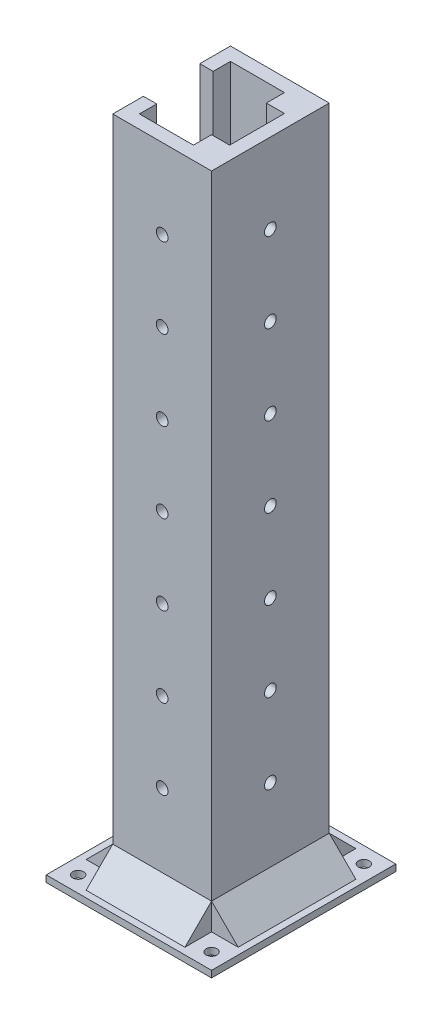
ISO-10303-21;
HEADER;
FILE_DESCRIPTION(('STEP AP214'),'2;1');
FILE_NAME('part.step','',(''),(''),'','','');
FILE_SCHEMA(('AUTOMOTIVE_DESIGN { 1 0 10303 214 1 1 1 1 }'));
ENDSEC;
DATA;
#1=APPLICATION_CONTEXT('core data for automotive mechanical design processes');
#2=APPLICATION_PROTOCOL_DEFINITION('international standard','automotive_design',2000,#1);
#3=PRODUCT_CONTEXT('',#1,'mechanical');
#4=PRODUCT('Part','Part','',(#3));
#5=PRODUCT_RELATED_PRODUCT_CATEGORY('part','',(#4));
#6=PRODUCT_DEFINITION_FORMATION('','',#4);
#7=PRODUCT_DEFINITION_CONTEXT('part definition',#1,'design');
#8=PRODUCT_DEFINITION('design','',#6,#7);
#9=PRODUCT_DEFINITION_SHAPE('','',#8);
#10=(LENGTH_UNIT() NAMED_UNIT(*) SI_UNIT(.MILLI.,.METRE.));
#11=(NAMED_UNIT(*) PLANE_ANGLE_UNIT() SI_UNIT($,.RADIAN.));
#12=(NAMED_UNIT(*) SI_UNIT($,.STERADIAN.) SOLID_ANGLE_UNIT());
#13=UNCERTAINTY_MEASURE_WITH_UNIT(LENGTH_MEASURE(1.E-05),#10,'distance_accuracy_value','');
#14=(GEOMETRIC_REPRESENTATION_CONTEXT(3) GLOBAL_UNCERTAINTY_ASSIGNED_CONTEXT((#13)) GLOBAL_UNIT_ASSIGNED_CONTEXT((#10,
#11,#12)) REPRESENTATION_CONTEXT('',''));
#15=CARTESIAN_POINT('',(0.,0.,0.));
#16=DIRECTION('',(0.,0.,1.));
#17=DIRECTION('',(1.,0.,0.));
#18=AXIS2_PLACEMENT_3D('',#15,#16,#17);
#19=CARTESIAN_POINT('',(0.,250.,0.));
#20=DIRECTION('',(0.,0.,-1.));
#21=DIRECTION('',(-1.,0.,0.));
#22=AXIS2_PLACEMENT_3D('',#19,#20,#21);
#23=PLANE('',#22);
#24=DIRECTION('',(0.,-1.,0.));
#25=VECTOR('',#24,1.);
#26=CARTESIAN_POINT('',(0.,12.4999999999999,0.));
#27=LINE('',#26,#25);
#28=CARTESIAN_POINT('',(0.,12.4999999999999,0.));
#29=VERTEX_POINT('',#28);
#30=CARTESIAN_POINT('',(0.,2.5,0.));
#31=VERTEX_POINT('',#30);
#32=EDGE_CURVE('E306',#29,#31,#27,.T.);
#33=ORIENTED_EDGE('',*,*,#32,.F.);
#34=DIRECTION('',(0.707106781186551,0.707106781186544,0.));
#35=VECTOR('',#34,1.);
#36=CARTESIAN_POINT('',(118.75,131.249999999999,0.));
#37=LINE('',#36,#35);
#38=CARTESIAN_POINT('',(-10.0000000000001,2.5,0.));
#39=VERTEX_POINT('',#38);
#40=EDGE_CURVE('E11',#29,#39,#37,.F.);
#41=ORIENTED_EDGE('',*,*,#40,.T.);
#42=DIRECTION('',(-1.,0.,0.));
#43=VECTOR('',#42,1.);
#44=CARTESIAN_POINT('',(0.,2.5,0.));
#45=LINE('',#44,#43);
#46=EDGE_CURVE('E559',#31,#39,#45,.T.);
#47=ORIENTED_EDGE('',*,*,#46,.F.);
#48=EDGE_LOOP('',(#33,#41,#47));
#49=FACE_BOUND('',#48,.T.);
#50=ADVANCED_FACE('F44',(#49),#23,.F.);
#51=CARTESIAN_POINT('',(18.55,220.,0.));
#52=DIRECTION('',(0.,0.,-1.));
#53=DIRECTION('',(-1.,0.,0.));
#54=AXIS2_PLACEMENT_3D('',#51,#52,#53);
#55=CIRCLE('',#54,2.20000000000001);
#56=CARTESIAN_POINT('',(16.35,220.,0.));
#57=VERTEX_POINT('',#56);
#58=EDGE_CURVE('E491',#57,#57,#55,.T.);
#59=ORIENTED_EDGE('',*,*,#58,.T.);
#60=EDGE_LOOP('',(#59));
#61=FACE_BOUND('',#60,.T.);
#62=CARTESIAN_POINT('',(18.5499999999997,190.,0.));
#63=DIRECTION('',(0.,0.,-1.));
#64=DIRECTION('',(-1.,0.,0.));
#65=AXIS2_PLACEMENT_3D('',#62,#63,#64);
#66=CIRCLE('',#65,2.20000000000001);
#67=CARTESIAN_POINT('',(16.3499999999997,190.,0.));
#68=VERTEX_POINT('',#67);
#69=EDGE_CURVE('E482',#68,#68,#66,.T.);
#70=ORIENTED_EDGE('',*,*,#69,.T.);
#71=EDGE_LOOP('',(#70));
#72=FACE_BOUND('',#71,.T.);
#73=CARTESIAN_POINT('',(18.5499999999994,160.,0.));
#74=DIRECTION('',(0.,0.,-1.));
#75=DIRECTION('',(-1.,0.,0.));
#76=AXIS2_PLACEMENT_3D('',#73,#74,#75);
#77=CIRCLE('',#76,2.20000000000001);
#78=CARTESIAN_POINT('',(16.3499999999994,160.,0.));
#79=VERTEX_POINT('',#78);
#80=EDGE_CURVE('E473',#79,#79,#77,.T.);
#81=ORIENTED_EDGE('',*,*,#80,.T.);
#82=EDGE_LOOP('',(#81));
#83=FACE_BOUND('',#82,.T.);
#84=CARTESIAN_POINT('',(18.5499999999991,130.,0.));
#85=DIRECTION('',(0.,0.,-1.));
#86=DIRECTION('',(-1.,0.,0.));
#87=AXIS2_PLACEMENT_3D('',#84,#85,#86);
#88=CIRCLE('',#87,2.20000000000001);
#89=CARTESIAN_POINT('',(16.3499999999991,130.,0.));
#90=VERTEX_POINT('',#89);
#91=EDGE_CURVE('E464',#90,#90,#88,.T.);
#92=ORIENTED_EDGE('',*,*,#91,.T.);
#93=EDGE_LOOP('',(#92));
#94=FACE_BOUND('',#93,.T.);
#95=CARTESIAN_POINT('',(18.5499999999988,100.,0.));
#96=DIRECTION('',(0.,0.,-1.));
#97=DIRECTION('',(-1.,0.,0.));
#98=AXIS2_PLACEMENT_3D('',#95,#96,#97);
#99=CIRCLE('',#98,2.20000000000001);
#100=CARTESIAN_POINT('',(16.3499999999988,100.,0.));
#101=VERTEX_POINT('',#100);
#102=EDGE_CURVE('E455',#101,#101,#99,.T.);
#103=ORIENTED_EDGE('',*,*,#102,.T.);
#104=EDGE_LOOP('',(#103));
#105=FACE_BOUND('',#104,.T.);
#106=CARTESIAN_POINT('',(18.5499999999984,70.,0.));
#107=DIRECTION('',(0.,0.,-1.));
#108=DIRECTION('',(-1.,0.,0.));
#109=AXIS2_PLACEMENT_3D('',#106,#107,#108);
#110=CIRCLE('',#109,2.20000000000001);
#111=CARTESIAN_POINT('',(16.3499999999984,70.,0.));
#112=VERTEX_POINT('',#111);
#113=EDGE_CURVE('E446',#112,#112,#110,.T.);
#114=ORIENTED_EDGE('',*,*,#113,.T.);
#115=EDGE_LOOP('',(#114));
#116=FACE_BOUND('',#115,.T.);
#117=CARTESIAN_POINT('',(18.5499999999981,40.,0.));
#118=DIRECTION('',(0.,0.,-1.));
#119=DIRECTION('',(-1.,0.,0.));
#120=AXIS2_PLACEMENT_3D('',#117,#118,#119);
#121=CIRCLE('',#120,2.20000000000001);
#122=CARTESIAN_POINT('',(16.3499999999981,40.,0.));
#123=VERTEX_POINT('',#122);
#124=EDGE_CURVE('E420',#123,#123,#121,.T.);
#125=ORIENTED_EDGE('',*,*,#124,.T.);
#126=EDGE_LOOP('',(#125));
#127=FACE_BOUND('',#126,.T.);
#128=DIRECTION('',(1.,0.,0.));
#129=VECTOR('',#128,1.);
#130=CARTESIAN_POINT('',(0.,12.4999999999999,0.));
#131=LINE('',#130,#129);
#132=CARTESIAN_POINT('',(37.1,12.4999999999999,0.));
#133=VERTEX_POINT('',#132);
#134=EDGE_CURVE('E303',#29,#133,#131,.T.);
#135=ORIENTED_EDGE('',*,*,#134,.T.);
#136=DIRECTION('',(0.,-1.,0.));
#137=VECTOR('',#136,1.);
#138=CARTESIAN_POINT('',(37.1,250.,0.));
#139=LINE('',#138,#137);
#140=CARTESIAN_POINT('',(37.1,250.,0.));
#141=VERTEX_POINT('',#140);
#142=EDGE_CURVE('E638',#141,#133,#139,.T.);
#143=ORIENTED_EDGE('',*,*,#142,.F.);
#144=DIRECTION('',(1.,0.,0.));
#145=VECTOR('',#144,1.);
#146=CARTESIAN_POINT('',(0.,250.,0.));
#147=LINE('',#146,#145);
#148=CARTESIAN_POINT('',(0.,250.,0.));
#149=VERTEX_POINT('',#148);
#150=EDGE_CURVE('E616',#149,#141,#147,.T.);
#151=ORIENTED_EDGE('',*,*,#150,.F.);
#152=DIRECTION('',(0.,-1.,0.));
#153=VECTOR('',#152,1.);
#154=CARTESIAN_POINT('',(0.,250.,0.));
#155=LINE('',#154,#153);
#156=EDGE_CURVE('E641',#149,#29,#155,.T.);
#157=ORIENTED_EDGE('',*,*,#156,.T.);
#158=EDGE_LOOP('',(#135,#143,#151,#157));
#159=FACE_BOUND('',#158,.T.);
#160=ADVANCED_FACE('F755',(#61,#72,#83,#94,#105,#116,#127,#159),#23,.F.);
#161=CARTESIAN_POINT('',(37.1,250.,-44.2));
#162=DIRECTION('',(0.,0.,1.));
#163=DIRECTION('',(1.,0.,0.));
#164=AXIS2_PLACEMENT_3D('',#161,#162,#163);
#165=PLANE('',#164);
#166=DIRECTION('',(-0.707106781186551,-0.707106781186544,0.));
#167=VECTOR('',#166,1.);
#168=CARTESIAN_POINT('',(137.3,149.799999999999,-44.2));
#169=LINE('',#168,#167);
#170=CARTESIAN_POINT('',(-10.0000000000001,2.5,-44.2));
#171=VERTEX_POINT('',#170);
#172=CARTESIAN_POINT('',(0.,12.5,-44.2));
#173=VERTEX_POINT('',#172);
#174=EDGE_CURVE('E699',#171,#173,#169,.F.);
#175=ORIENTED_EDGE('',*,*,#174,.T.);
#176=DIRECTION('',(0.,-1.,0.));
#177=VECTOR('',#176,1.);
#178=CARTESIAN_POINT('',(0.,12.4999999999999,-44.2));
#179=LINE('',#178,#177);
#180=CARTESIAN_POINT('',(0.,2.5,-44.2));
#181=VERTEX_POINT('',#180);
#182=EDGE_CURVE('E280',#173,#181,#179,.T.);
#183=ORIENTED_EDGE('',*,*,#182,.T.);
#184=DIRECTION('',(1.,0.,0.));
#185=VECTOR('',#184,1.);
#186=CARTESIAN_POINT('',(37.1,2.5,-44.2));
#187=LINE('',#186,#185);
#188=EDGE_CURVE('E557',#171,#181,#187,.T.);
#189=ORIENTED_EDGE('',*,*,#188,.F.);
#190=EDGE_LOOP('',(#175,#183,#189));
#191=FACE_BOUND('',#190,.T.);
#192=ADVANCED_FACE('F745',(#191),#165,.F.);
#193=DIRECTION('',(0.,-1.,0.));
#194=VECTOR('',#193,1.);
#195=CARTESIAN_POINT('',(37.1,12.4999999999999,-44.2));
#196=LINE('',#195,#194);
#197=CARTESIAN_POINT('',(37.1,12.5,-44.2));
#198=VERTEX_POINT('',#197);
#199=CARTESIAN_POINT('',(37.1,2.5,-44.2));
#200=VERTEX_POINT('',#199);
#201=EDGE_CURVE('E288',#198,#200,#196,.T.);
#202=ORIENTED_EDGE('',*,*,#201,.F.);
#203=DIRECTION('',(-0.707106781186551,0.707106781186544,0.));
#204=VECTOR('',#203,1.);
#205=CARTESIAN_POINT('',(-81.65,131.249999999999,-44.2));
#206=LINE('',#205,#204);
#207=CARTESIAN_POINT('',(47.1000000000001,2.5,-44.2));
#208=VERTEX_POINT('',#207);
#209=EDGE_CURVE('E696',#198,#208,#206,.F.);
#210=ORIENTED_EDGE('',*,*,#209,.T.);
#211=EDGE_CURVE('E551',#200,#208,#187,.T.);
#212=ORIENTED_EDGE('',*,*,#211,.F.);
#213=EDGE_LOOP('',(#202,#210,#212));
#214=FACE_BOUND('',#213,.T.);
#215=ADVANCED_FACE('F743',(#214),#165,.F.);
#216=CARTESIAN_POINT('',(0.,2.5,0.));
#217=DIRECTION('',(0.,-1.,0.));
#218=DIRECTION('',(0.,0.,-1.));
#219=AXIS2_PLACEMENT_3D('',#216,#217,#218);
#220=PLANE('',#219);
#221=DIRECTION('',(0.,0.,1.));
#222=VECTOR('',#221,1.);
#223=CARTESIAN_POINT('',(49.6,2.5,12.5));
#224=LINE('',#223,#222);
#225=CARTESIAN_POINT('',(49.6,2.5,-56.7));
#226=VERTEX_POINT('',#225);
#227=CARTESIAN_POINT('',(49.6,2.5,12.5));
#228=VERTEX_POINT('',#227);
#229=EDGE_CURVE('E525',#226,#228,#224,.T.);
#230=ORIENTED_EDGE('',*,*,#229,.F.);
#231=DIRECTION('',(1.,0.,0.));
#232=VECTOR('',#231,1.);
#233=CARTESIAN_POINT('',(-12.5,2.5,-56.7));
#234=LINE('',#233,#232);
#235=CARTESIAN_POINT('',(-12.5,2.5,-56.7));
#236=VERTEX_POINT('',#235);
#237=EDGE_CURVE('E535',#236,#226,#234,.T.);
#238=ORIENTED_EDGE('',*,*,#237,.F.);
#239=DIRECTION('',(0.,0.,-1.));
#240=VECTOR('',#239,1.);
#241=CARTESIAN_POINT('',(-12.5,2.5,12.5));
#242=LINE('',#241,#240);
#243=CARTESIAN_POINT('',(-12.5,2.5,12.5));
#244=VERTEX_POINT('',#243);
#245=EDGE_CURVE('E532',#244,#236,#242,.T.);
#246=ORIENTED_EDGE('',*,*,#245,.F.);
#247=DIRECTION('',(-1.,0.,0.));
#248=VECTOR('',#247,1.);
#249=CARTESIAN_POINT('',(-12.5,2.5,12.5));
#250=LINE('',#249,#248);
#251=EDGE_CURVE('E528',#228,#244,#250,.T.);
#252=ORIENTED_EDGE('',*,*,#251,.F.);
#253=EDGE_LOOP('',(#230,#238,#246,#252));
#254=FACE_BOUND('',#253,.T.);
#255=CARTESIAN_POINT('',(43.6,2.5,-50.7));
#256=DIRECTION('',(0.,-1.,0.));
#257=DIRECTION('',(0.,0.,-1.));
#258=AXIS2_PLACEMENT_3D('',#255,#256,#257);
#259=CIRCLE('',#258,2.04999999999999);
#260=CARTESIAN_POINT('',(43.6,2.5,-52.75));
#261=VERTEX_POINT('',#260);
#262=EDGE_CURVE('E519',#261,#261,#259,.T.);
#263=ORIENTED_EDGE('',*,*,#262,.T.);
#264=EDGE_LOOP('',(#263));
#265=FACE_BOUND('',#264,.T.);
#266=CARTESIAN_POINT('',(-6.50000000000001,2.5,-50.7));
#267=DIRECTION('',(0.,-1.,0.));
#268=DIRECTION('',(0.,0.,1.));
#269=AXIS2_PLACEMENT_3D('',#266,#267,#268);
#270=CIRCLE('',#269,2.05000000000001);
#271=CARTESIAN_POINT('',(-6.50000000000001,2.5,-48.65));
#272=VERTEX_POINT('',#271);
#273=EDGE_CURVE('E513',#272,#272,#270,.T.);
#274=ORIENTED_EDGE('',*,*,#273,.T.);
#275=EDGE_LOOP('',(#274));
#276=FACE_BOUND('',#275,.T.);
#277=CARTESIAN_POINT('',(-6.5,2.5,6.50000000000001));
#278=DIRECTION('',(0.,-1.,0.));
#279=DIRECTION('',(0.,0.,-1.));
#280=AXIS2_PLACEMENT_3D('',#277,#278,#279);
#281=CIRCLE('',#280,2.05);
#282=CARTESIAN_POINT('',(-6.5,2.5,4.45000000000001));
#283=VERTEX_POINT('',#282);
#284=EDGE_CURVE('E507',#283,#283,#281,.T.);
#285=ORIENTED_EDGE('',*,*,#284,.T.);
#286=EDGE_LOOP('',(#285));
#287=FACE_BOUND('',#286,.T.);
#288=CARTESIAN_POINT('',(43.6,2.5,6.5));
#289=DIRECTION('',(0.,-1.,0.));
#290=DIRECTION('',(0.,0.,1.));
#291=AXIS2_PLACEMENT_3D('',#288,#289,#290);
#292=CIRCLE('',#291,2.04999999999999);
#293=CARTESIAN_POINT('',(43.6,2.5,8.54999999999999));
#294=VERTEX_POINT('',#293);
#295=EDGE_CURVE('E501',#294,#294,#292,.T.);
#296=ORIENTED_EDGE('',*,*,#295,.T.);
#297=EDGE_LOOP('',(#296));
#298=FACE_BOUND('',#297,.T.);
#299=ORIENTED_EDGE('',*,*,#188,.T.);
#300=DIRECTION('',(0.,0.,-1.));
#301=VECTOR('',#300,1.);
#302=CARTESIAN_POINT('',(0.,2.5,-44.2));
#303=LINE('',#302,#301);
#304=CARTESIAN_POINT('',(0.,2.5,-54.2));
#305=VERTEX_POINT('',#304);
#306=EDGE_CURVE('E60',#181,#305,#303,.T.);
#307=ORIENTED_EDGE('',*,*,#306,.T.);
#308=DIRECTION('',(1.,0.,0.));
#309=VECTOR('',#308,1.);
#310=CARTESIAN_POINT('',(0.,2.5,-54.2));
#311=LINE('',#310,#309);
#312=CARTESIAN_POINT('',(37.1,2.5,-54.2));
#313=VERTEX_POINT('',#312);
#314=EDGE_CURVE('E270',#305,#313,#311,.T.);
#315=ORIENTED_EDGE('',*,*,#314,.T.);
#316=DIRECTION('',(0.,0.,-1.));
#317=VECTOR('',#316,1.);
#318=CARTESIAN_POINT('',(37.1,2.5,-44.2));
#319=LINE('',#318,#317);
#320=EDGE_CURVE('E274',#200,#313,#319,.T.);
#321=ORIENTED_EDGE('',*,*,#320,.F.);
#322=ORIENTED_EDGE('',*,*,#211,.T.);
#323=DIRECTION('',(0.,0.,1.));
#324=VECTOR('',#323,1.);
#325=CARTESIAN_POINT('',(47.1000000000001,2.5,0.));
#326=LINE('',#325,#324);
#327=CARTESIAN_POINT('',(47.1000000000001,2.5,0.));
#328=VERTEX_POINT('',#327);
#329=EDGE_CURVE('E682',#208,#328,#326,.T.);
#330=ORIENTED_EDGE('',*,*,#329,.T.);
#331=CARTESIAN_POINT('',(37.1,2.5,0.));
#332=VERTEX_POINT('',#331);
#333=EDGE_CURVE('E560',#328,#332,#45,.T.);
#334=ORIENTED_EDGE('',*,*,#333,.T.);
#335=DIRECTION('',(0.,0.,1.));
#336=VECTOR('',#335,1.);
#337=CARTESIAN_POINT('',(37.1,2.5,0.));
#338=LINE('',#337,#336);
#339=CARTESIAN_POINT('',(37.1,2.5,10.));
#340=VERTEX_POINT('',#339);
#341=EDGE_CURVE('E291',#332,#340,#338,.T.);
#342=ORIENTED_EDGE('',*,*,#341,.T.);
#343=DIRECTION('',(1.,0.,0.));
#344=VECTOR('',#343,1.);
#345=CARTESIAN_POINT('',(0.,2.5,10.));
#346=LINE('',#345,#344);
#347=CARTESIAN_POINT('',(0.,2.5,10.));
#348=VERTEX_POINT('',#347);
#349=EDGE_CURVE('E68',#348,#340,#346,.T.);
#350=ORIENTED_EDGE('',*,*,#349,.F.);
#351=DIRECTION('',(0.,0.,1.));
#352=VECTOR('',#351,1.);
#353=CARTESIAN_POINT('',(0.,2.5,0.));
#354=LINE('',#353,#352);
#355=EDGE_CURVE('E310',#31,#348,#354,.T.);
#356=ORIENTED_EDGE('',*,*,#355,.F.);
#357=ORIENTED_EDGE('',*,*,#46,.T.);
#358=DIRECTION('',(0.,0.,-1.));
#359=VECTOR('',#358,1.);
#360=CARTESIAN_POINT('',(-10.0000000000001,2.5,-11.5));
#361=LINE('',#360,#359);
#362=CARTESIAN_POINT('',(-10.0000000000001,2.5,-11.5));
#363=VERTEX_POINT('',#362);
#364=EDGE_CURVE('E676',#39,#363,#361,.T.);
#365=ORIENTED_EDGE('',*,*,#364,.T.);
#366=DIRECTION('',(1.,0.,0.));
#367=VECTOR('',#366,1.);
#368=CARTESIAN_POINT('',(4.99999999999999,2.5,-11.5));
#369=LINE('',#368,#367);
#370=CARTESIAN_POINT('',(4.99999999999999,2.5,-11.5));
#371=VERTEX_POINT('',#370);
#372=EDGE_CURVE('E563',#363,#371,#369,.T.);
#373=ORIENTED_EDGE('',*,*,#372,.T.);
#374=DIRECTION('',(0.,0.,1.));
#375=VECTOR('',#374,1.);
#376=CARTESIAN_POINT('',(4.99999999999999,2.5,-5.));
#377=LINE('',#376,#375);
#378=CARTESIAN_POINT('',(4.99999999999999,2.5,-5.));
#379=VERTEX_POINT('',#378);
#380=EDGE_CURVE('E566',#371,#379,#377,.T.);
#381=ORIENTED_EDGE('',*,*,#380,.T.);
#382=DIRECTION('',(1.,0.,0.));
#383=VECTOR('',#382,1.);
#384=CARTESIAN_POINT('',(25.3,2.5,-5.));
#385=LINE('',#384,#383);
#386=CARTESIAN_POINT('',(25.3,2.5,-5.));
#387=VERTEX_POINT('',#386);
#388=EDGE_CURVE('E569',#379,#387,#385,.T.);
#389=ORIENTED_EDGE('',*,*,#388,.T.);
#390=DIRECTION('',(0.,0.,-1.));
#391=VECTOR('',#390,1.);
#392=CARTESIAN_POINT('',(25.3,2.5,-11.8));
#393=LINE('',#392,#391);
#394=CARTESIAN_POINT('',(25.3,2.5,-11.8));
#395=VERTEX_POINT('',#394);
#396=EDGE_CURVE('E572',#387,#395,#393,.T.);
#397=ORIENTED_EDGE('',*,*,#396,.T.);
#398=DIRECTION('',(1.,0.,0.));
#399=VECTOR('',#398,1.);
#400=CARTESIAN_POINT('',(32.1,2.5,-11.8));
#401=LINE('',#400,#399);
#402=CARTESIAN_POINT('',(32.1,2.5,-11.8));
#403=VERTEX_POINT('',#402);
#404=EDGE_CURVE('E575',#395,#403,#401,.T.);
#405=ORIENTED_EDGE('',*,*,#404,.T.);
#406=DIRECTION('',(0.,0.,-1.));
#407=VECTOR('',#406,1.);
#408=CARTESIAN_POINT('',(32.1,2.5,-32.4));
#409=LINE('',#408,#407);
#410=CARTESIAN_POINT('',(32.1,2.5,-32.4));
#411=VERTEX_POINT('',#410);
#412=EDGE_CURVE('E578',#403,#411,#409,.T.);
#413=ORIENTED_EDGE('',*,*,#412,.T.);
#414=DIRECTION('',(-1.,0.,0.));
#415=VECTOR('',#414,1.);
#416=CARTESIAN_POINT('',(25.3,2.5,-32.4));
#417=LINE('',#416,#415);
#418=CARTESIAN_POINT('',(25.3,2.5,-32.4));
#419=VERTEX_POINT('',#418);
#420=EDGE_CURVE('E581',#411,#419,#417,.T.);
#421=ORIENTED_EDGE('',*,*,#420,.T.);
#422=DIRECTION('',(0.,0.,-1.));
#423=VECTOR('',#422,1.);
#424=CARTESIAN_POINT('',(25.3,2.5,-39.2));
#425=LINE('',#424,#423);
#426=CARTESIAN_POINT('',(25.3,2.5,-39.2));
#427=VERTEX_POINT('',#426);
#428=EDGE_CURVE('E584',#419,#427,#425,.T.);
#429=ORIENTED_EDGE('',*,*,#428,.T.);
#430=DIRECTION('',(-1.,0.,0.));
#431=VECTOR('',#430,1.);
#432=CARTESIAN_POINT('',(4.99999999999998,2.5,-39.2));
#433=LINE('',#432,#431);
#434=CARTESIAN_POINT('',(4.99999999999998,2.5,-39.2));
#435=VERTEX_POINT('',#434);
#436=EDGE_CURVE('E587',#427,#435,#433,.T.);
#437=ORIENTED_EDGE('',*,*,#436,.T.);
#438=DIRECTION('',(0.,0.,1.));
#439=VECTOR('',#438,1.);
#440=CARTESIAN_POINT('',(4.99999999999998,2.5,-32.7));
#441=LINE('',#440,#439);
#442=CARTESIAN_POINT('',(4.99999999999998,2.5,-32.7));
#443=VERTEX_POINT('',#442);
#444=EDGE_CURVE('E590',#435,#443,#441,.T.);
#445=ORIENTED_EDGE('',*,*,#444,.T.);
#446=DIRECTION('',(-1.,0.,0.));
#447=VECTOR('',#446,1.);
#448=CARTESIAN_POINT('',(0.,2.5,-32.7));
#449=LINE('',#448,#447);
#450=CARTESIAN_POINT('',(-10.0000000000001,2.5,-32.7));
#451=VERTEX_POINT('',#450);
#452=EDGE_CURVE('E674',#443,#451,#449,.T.);
#453=ORIENTED_EDGE('',*,*,#452,.T.);
#454=DIRECTION('',(0.,0.,-1.));
#455=VECTOR('',#454,1.);
#456=CARTESIAN_POINT('',(-10.0000000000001,2.5,-44.2));
#457=LINE('',#456,#455);
#458=EDGE_CURVE('E679',#451,#171,#457,.T.);
#459=ORIENTED_EDGE('',*,*,#458,.T.);
#460=EDGE_LOOP('',(#299,#307,#315,#321,#322,#330,#334,#342,#350,#356,#357,#365,#373,#381,#389,
#397,#405,#413,#421,#429,#437,#445,#453,#459));
#461=FACE_BOUND('',#460,.T.);
#462=ADVANCED_FACE('F272',(#254,#265,#276,#287,#298,#461),#220,.F.);
#463=CARTESIAN_POINT('',(0.,0.,0.));
#464=DIRECTION('',(0.,-1.,0.));
#465=DIRECTION('',(0.,0.,-1.));
#466=AXIS2_PLACEMENT_3D('',#463,#464,#465);
#467=PLANE('',#466);
#468=CARTESIAN_POINT('',(43.6,0.,6.5));
#469=DIRECTION('',(0.,-1.,0.));
#470=DIRECTION('',(0.,0.,1.));
#471=AXIS2_PLACEMENT_3D('',#468,#469,#470);
#472=CIRCLE('',#471,2.04999999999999);
#473=CARTESIAN_POINT('',(43.6,0.,8.54999999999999));
#474=VERTEX_POINT('',#473);
#475=EDGE_CURVE('E500',#474,#474,#472,.T.);
#476=ORIENTED_EDGE('',*,*,#475,.F.);
#477=EDGE_LOOP('',(#476));
#478=FACE_BOUND('',#477,.T.);
#479=CARTESIAN_POINT('',(-6.5,0.,6.50000000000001));
#480=DIRECTION('',(0.,-1.,0.));
#481=DIRECTION('',(0.,0.,-1.));
#482=AXIS2_PLACEMENT_3D('',#479,#480,#481);
#483=CIRCLE('',#482,2.05);
#484=CARTESIAN_POINT('',(-6.5,0.,4.45000000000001));
#485=VERTEX_POINT('',#484);
#486=EDGE_CURVE('E504',#485,#485,#483,.T.);
#487=ORIENTED_EDGE('',*,*,#486,.F.);
#488=EDGE_LOOP('',(#487));
#489=FACE_BOUND('',#488,.T.);
#490=CARTESIAN_POINT('',(-6.50000000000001,0.,-50.7));
#491=DIRECTION('',(0.,-1.,0.));
#492=DIRECTION('',(0.,0.,1.));
#493=AXIS2_PLACEMENT_3D('',#490,#491,#492);
#494=CIRCLE('',#493,2.05000000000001);
#495=CARTESIAN_POINT('',(-6.50000000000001,0.,-48.65));
#496=VERTEX_POINT('',#495);
#497=EDGE_CURVE('E510',#496,#496,#494,.T.);
#498=ORIENTED_EDGE('',*,*,#497,.F.);
#499=EDGE_LOOP('',(#498));
#500=FACE_BOUND('',#499,.T.);
#501=CARTESIAN_POINT('',(43.6,0.,-50.7));
#502=DIRECTION('',(0.,-1.,0.));
#503=DIRECTION('',(0.,0.,-1.));
#504=AXIS2_PLACEMENT_3D('',#501,#502,#503);
#505=CIRCLE('',#504,2.04999999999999);
#506=CARTESIAN_POINT('',(43.6,0.,-52.75));
#507=VERTEX_POINT('',#506);
#508=EDGE_CURVE('E516',#507,#507,#505,.T.);
#509=ORIENTED_EDGE('',*,*,#508,.F.);
#510=EDGE_LOOP('',(#509));
#511=FACE_BOUND('',#510,.T.);
#512=DIRECTION('',(0.,0.,1.));
#513=VECTOR('',#512,1.);
#514=CARTESIAN_POINT('',(49.6,0.,12.5));
#515=LINE('',#514,#513);
#516=CARTESIAN_POINT('',(49.6,0.,-56.7));
#517=VERTEX_POINT('',#516);
#518=CARTESIAN_POINT('',(49.6,0.,12.5));
#519=VERTEX_POINT('',#518);
#520=EDGE_CURVE('E522',#517,#519,#515,.T.);
#521=ORIENTED_EDGE('',*,*,#520,.T.);
#522=DIRECTION('',(-1.,0.,0.));
#523=VECTOR('',#522,1.);
#524=CARTESIAN_POINT('',(-12.5,0.,12.5));
#525=LINE('',#524,#523);
#526=CARTESIAN_POINT('',(-12.5,0.,12.5));
#527=VERTEX_POINT('',#526);
#528=EDGE_CURVE('E541',#519,#527,#525,.T.);
#529=ORIENTED_EDGE('',*,*,#528,.T.);
#530=DIRECTION('',(0.,0.,-1.));
#531=VECTOR('',#530,1.);
#532=CARTESIAN_POINT('',(-12.5,0.,12.5));
#533=LINE('',#532,#531);
#534=CARTESIAN_POINT('',(-12.5,0.,-56.7));
#535=VERTEX_POINT('',#534);
#536=EDGE_CURVE('E544',#527,#535,#533,.T.);
#537=ORIENTED_EDGE('',*,*,#536,.T.);
#538=DIRECTION('',(1.,0.,0.));
#539=VECTOR('',#538,1.);
#540=CARTESIAN_POINT('',(-12.5,0.,-56.7));
#541=LINE('',#540,#539);
#542=EDGE_CURVE('E529',#535,#517,#541,.T.);
#543=ORIENTED_EDGE('',*,*,#542,.T.);
#544=EDGE_LOOP('',(#521,#529,#537,#543));
#545=FACE_BOUND('',#544,.T.);
#546=DIRECTION('',(1.,0.,0.));
#547=VECTOR('',#546,1.);
#548=CARTESIAN_POINT('',(37.1,0.,-44.2));
#549=LINE('',#548,#547);
#550=CARTESIAN_POINT('',(0.,0.,-44.2));
#551=VERTEX_POINT('',#550);
#552=CARTESIAN_POINT('',(37.1,0.,-44.2));
#553=VERTEX_POINT('',#552);
#554=EDGE_CURVE('E359',#551,#553,#549,.T.);
#555=ORIENTED_EDGE('',*,*,#554,.F.);
#556=DIRECTION('',(0.,0.,-1.));
#557=VECTOR('',#556,1.);
#558=CARTESIAN_POINT('',(0.,0.,-44.2));
#559=LINE('',#558,#557);
#560=CARTESIAN_POINT('',(0.,0.,0.));
#561=VERTEX_POINT('',#560);
#562=EDGE_CURVE('E345',#561,#551,#559,.T.);
#563=ORIENTED_EDGE('',*,*,#562,.F.);
#564=DIRECTION('',(-1.,0.,0.));
#565=VECTOR('',#564,1.);
#566=CARTESIAN_POINT('',(37.1,0.,0.));
#567=LINE('',#566,#565);
#568=CARTESIAN_POINT('',(37.1,0.,0.));
#569=VERTEX_POINT('',#568);
#570=EDGE_CURVE('E350',#569,#561,#567,.T.);
#571=ORIENTED_EDGE('',*,*,#570,.F.);
#572=DIRECTION('',(0.,0.,1.));
#573=VECTOR('',#572,1.);
#574=CARTESIAN_POINT('',(37.1,0.,-44.2));
#575=LINE('',#574,#573);
#576=EDGE_CURVE('E361',#553,#569,#575,.T.);
#577=ORIENTED_EDGE('',*,*,#576,.F.);
#578=EDGE_LOOP('',(#555,#563,#571,#577));
#579=FACE_BOUND('',#578,.T.);
#580=ADVANCED_FACE('F752',(#478,#489,#500,#511,#545,#579),#467,.T.);
#581=CARTESIAN_POINT('',(4.99999999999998,250.,-32.7));
#582=DIRECTION('',(-1.,0.,0.));
#583=DIRECTION('',(0.,0.,1.));
#584=AXIS2_PLACEMENT_3D('',#581,#582,#583);
#585=PLANE('',#584);
#586=ORIENTED_EDGE('',*,*,#444,.F.);
#587=DIRECTION('',(0.,-1.,0.));
#588=VECTOR('',#587,1.);
#589=CARTESIAN_POINT('',(4.99999999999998,250.,-39.2));
#590=LINE('',#589,#588);
#591=CARTESIAN_POINT('',(4.99999999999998,250.,-39.2));
#592=VERTEX_POINT('',#591);
#593=EDGE_CURVE('E671',#592,#435,#590,.T.);
#594=ORIENTED_EDGE('',*,*,#593,.F.);
#595=DIRECTION('',(0.,0.,-1.));
#596=VECTOR('',#595,1.);
#597=CARTESIAN_POINT('',(4.99999999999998,250.,-32.7));
#598=LINE('',#597,#596);
#599=CARTESIAN_POINT('',(4.99999999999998,250.,-32.7));
#600=VERTEX_POINT('',#599);
#601=EDGE_CURVE('E593',#600,#592,#598,.T.);
#602=ORIENTED_EDGE('',*,*,#601,.F.);
#603=DIRECTION('',(0.,-1.,0.));
#604=VECTOR('',#603,1.);
#605=CARTESIAN_POINT('',(4.99999999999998,250.,-32.7));
#606=LINE('',#605,#604);
#607=EDGE_CURVE('E626',#600,#443,#606,.T.);
#608=ORIENTED_EDGE('',*,*,#607,.T.);
#609=EDGE_LOOP('',(#586,#594,#602,#608));
#610=FACE_BOUND('',#609,.T.);
#611=ADVANCED_FACE('F812',(#610),#585,.F.);
#612=CARTESIAN_POINT('',(4.99999999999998,250.,-39.2));
#613=DIRECTION('',(0.,0.,-1.));
#614=DIRECTION('',(-1.,0.,0.));
#615=AXIS2_PLACEMENT_3D('',#612,#613,#614);
#616=PLANE('',#615);
#617=CARTESIAN_POINT('',(18.55,220.,-39.2));
#618=DIRECTION('',(0.,0.,-1.));
#619=DIRECTION('',(-1.,0.,0.));
#620=AXIS2_PLACEMENT_3D('',#617,#618,#619);
#621=CIRCLE('',#620,2.20000000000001);
#622=CARTESIAN_POINT('',(16.35,220.,-39.2));
#623=VERTEX_POINT('',#622);
#624=EDGE_CURVE('E497',#623,#623,#621,.T.);
#625=ORIENTED_EDGE('',*,*,#624,.T.);
#626=EDGE_LOOP('',(#625));
#627=FACE_BOUND('',#626,.T.);
#628=CARTESIAN_POINT('',(18.5499999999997,190.,-39.2));
#629=DIRECTION('',(0.,0.,-1.));
#630=DIRECTION('',(-1.,0.,0.));
#631=AXIS2_PLACEMENT_3D('',#628,#629,#630);
#632=CIRCLE('',#631,2.20000000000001);
#633=CARTESIAN_POINT('',(16.3499999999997,190.,-39.2));
#634=VERTEX_POINT('',#633);
#635=EDGE_CURVE('E488',#634,#634,#632,.T.);
#636=ORIENTED_EDGE('',*,*,#635,.T.);
#637=EDGE_LOOP('',(#636));
#638=FACE_BOUND('',#637,.T.);
#639=CARTESIAN_POINT('',(18.5499999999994,160.,-39.2));
#640=DIRECTION('',(0.,0.,-1.));
#641=DIRECTION('',(-1.,0.,0.));
#642=AXIS2_PLACEMENT_3D('',#639,#640,#641);
#643=CIRCLE('',#642,2.20000000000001);
#644=CARTESIAN_POINT('',(16.3499999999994,160.,-39.2));
#645=VERTEX_POINT('',#644);
#646=EDGE_CURVE('E479',#645,#645,#643,.T.);
#647=ORIENTED_EDGE('',*,*,#646,.T.);
#648=EDGE_LOOP('',(#647));
#649=FACE_BOUND('',#648,.T.);
#650=CARTESIAN_POINT('',(18.5499999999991,130.,-39.2));
#651=DIRECTION('',(0.,0.,-1.));
#652=DIRECTION('',(-1.,0.,0.));
#653=AXIS2_PLACEMENT_3D('',#650,#651,#652);
#654=CIRCLE('',#653,2.20000000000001);
#655=CARTESIAN_POINT('',(16.3499999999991,130.,-39.2));
#656=VERTEX_POINT('',#655);
#657=EDGE_CURVE('E470',#656,#656,#654,.T.);
#658=ORIENTED_EDGE('',*,*,#657,.T.);
#659=EDGE_LOOP('',(#658));
#660=FACE_BOUND('',#659,.T.);
#661=CARTESIAN_POINT('',(18.5499999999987,100.,-39.2));
#662=DIRECTION('',(0.,0.,-1.));
#663=DIRECTION('',(-1.,0.,0.));
#664=AXIS2_PLACEMENT_3D('',#661,#662,#663);
#665=CIRCLE('',#664,2.20000000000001);
#666=CARTESIAN_POINT('',(16.3499999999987,100.,-39.2));
#667=VERTEX_POINT('',#666);
#668=EDGE_CURVE('E461',#667,#667,#665,.T.);
#669=ORIENTED_EDGE('',*,*,#668,.T.);
#670=EDGE_LOOP('',(#669));
#671=FACE_BOUND('',#670,.T.);
#672=CARTESIAN_POINT('',(18.5499999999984,70.,-39.2));
#673=DIRECTION('',(0.,0.,-1.));
#674=DIRECTION('',(-1.,0.,0.));
#675=AXIS2_PLACEMENT_3D('',#672,#673,#674);
#676=CIRCLE('',#675,2.20000000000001);
#677=CARTESIAN_POINT('',(16.3499999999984,70.,-39.2));
#678=VERTEX_POINT('',#677);
#679=EDGE_CURVE('E452',#678,#678,#676,.T.);
#680=ORIENTED_EDGE('',*,*,#679,.T.);
#681=EDGE_LOOP('',(#680));
#682=FACE_BOUND('',#681,.T.);
#683=CARTESIAN_POINT('',(18.5499999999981,40.,-39.2));
#684=DIRECTION('',(0.,0.,-1.));
#685=DIRECTION('',(-1.,0.,0.));
#686=AXIS2_PLACEMENT_3D('',#683,#684,#685);
#687=CIRCLE('',#686,2.20000000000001);
#688=CARTESIAN_POINT('',(16.3499999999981,40.,-39.2));
#689=VERTEX_POINT('',#688);
#690=EDGE_CURVE('E443',#689,#689,#687,.T.);
#691=ORIENTED_EDGE('',*,*,#690,.T.);
#692=EDGE_LOOP('',(#691));
#693=FACE_BOUND('',#692,.T.);
#694=ORIENTED_EDGE('',*,*,#436,.F.);
#695=DIRECTION('',(0.,-1.,0.));
#696=VECTOR('',#695,1.);
#697=CARTESIAN_POINT('',(25.3,250.,-39.2));
#698=LINE('',#697,#696);
#699=CARTESIAN_POINT('',(25.3,250.,-39.2));
#700=VERTEX_POINT('',#699);
#701=EDGE_CURVE('E668',#700,#427,#698,.T.);
#702=ORIENTED_EDGE('',*,*,#701,.F.);
#703=DIRECTION('',(1.,0.,0.));
#704=VECTOR('',#703,1.);
#705=CARTESIAN_POINT('',(4.99999999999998,250.,-39.2));
#706=LINE('',#705,#704);
#707=EDGE_CURVE('E596',#592,#700,#706,.T.);
#708=ORIENTED_EDGE('',*,*,#707,.F.);
#709=ORIENTED_EDGE('',*,*,#593,.T.);
#710=EDGE_LOOP('',(#694,#702,#708,#709));
#711=FACE_BOUND('',#710,.T.);
#712=ADVANCED_FACE('F808',(#627,#638,#649,#660,#671,#682,#693,#711),#616,.F.);
#713=CARTESIAN_POINT('',(25.3,250.,-39.2));
#714=DIRECTION('',(1.,0.,0.));
#715=DIRECTION('',(0.,0.,-1.));
#716=AXIS2_PLACEMENT_3D('',#713,#714,#715);
#717=PLANE('',#716);
#718=ORIENTED_EDGE('',*,*,#428,.F.);
#719=DIRECTION('',(0.,-1.,0.));
#720=VECTOR('',#719,1.);
#721=CARTESIAN_POINT('',(25.3,250.,-32.4));
#722=LINE('',#721,#720);
#723=CARTESIAN_POINT('',(25.3,250.,-32.4));
#724=VERTEX_POINT('',#723);
#725=EDGE_CURVE('E665',#724,#419,#722,.T.);
#726=ORIENTED_EDGE('',*,*,#725,.F.);
#727=DIRECTION('',(0.,0.,1.));
#728=VECTOR('',#727,1.);
#729=CARTESIAN_POINT('',(25.3,250.,-39.2));
#730=LINE('',#729,#728);
#731=EDGE_CURVE('E598',#700,#724,#730,.T.);
#732=ORIENTED_EDGE('',*,*,#731,.F.);
#733=ORIENTED_EDGE('',*,*,#701,.T.);
#734=EDGE_LOOP('',(#718,#726,#732,#733));
#735=FACE_BOUND('',#734,.T.);
#736=ADVANCED_FACE('F804',(#735),#717,.F.);
#737=CARTESIAN_POINT('',(25.3,250.,-32.4));
#738=DIRECTION('',(0.,0.,-1.));
#739=DIRECTION('',(-1.,0.,0.));
#740=AXIS2_PLACEMENT_3D('',#737,#738,#739);
#741=PLANE('',#740);
#742=ORIENTED_EDGE('',*,*,#420,.F.);
#743=DIRECTION('',(0.,-1.,0.));
#744=VECTOR('',#743,1.);
#745=CARTESIAN_POINT('',(32.1,250.,-32.4));
#746=LINE('',#745,#744);
#747=CARTESIAN_POINT('',(32.1,250.,-32.4));
#748=VERTEX_POINT('',#747);
#749=EDGE_CURVE('E662',#748,#411,#746,.T.);
#750=ORIENTED_EDGE('',*,*,#749,.F.);
#751=DIRECTION('',(1.,0.,0.));
#752=VECTOR('',#751,1.);
#753=CARTESIAN_POINT('',(25.3,250.,-32.4));
#754=LINE('',#753,#752);
#755=EDGE_CURVE('E600',#724,#748,#754,.T.);
#756=ORIENTED_EDGE('',*,*,#755,.F.);
#757=ORIENTED_EDGE('',*,*,#725,.T.);
#758=EDGE_LOOP('',(#742,#750,#756,#757));
#759=FACE_BOUND('',#758,.T.);
#760=ADVANCED_FACE('F800',(#759),#741,.F.);
#761=CARTESIAN_POINT('',(32.1,250.,-32.4));
#762=DIRECTION('',(1.,0.,0.));
#763=DIRECTION('',(0.,0.,-1.));
#764=AXIS2_PLACEMENT_3D('',#761,#762,#763);
#765=PLANE('',#764);
#766=CARTESIAN_POINT('',(32.1,220.,-22.1));
#767=DIRECTION('',(1.,0.,0.));
#768=DIRECTION('',(0.,0.,-1.));
#769=AXIS2_PLACEMENT_3D('',#766,#767,#768);
#770=CIRCLE('',#769,2.20000000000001);
#771=CARTESIAN_POINT('',(32.1,220.,-24.3));
#772=VERTEX_POINT('',#771);
#773=EDGE_CURVE('E413',#772,#772,#770,.T.);
#774=ORIENTED_EDGE('',*,*,#773,.T.);
#775=EDGE_LOOP('',(#774));
#776=FACE_BOUND('',#775,.T.);
#777=CARTESIAN_POINT('',(32.1,190.,-22.1000000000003));
#778=DIRECTION('',(1.,0.,0.));
#779=DIRECTION('',(0.,0.,-1.));
#780=AXIS2_PLACEMENT_3D('',#777,#778,#779);
#781=CIRCLE('',#780,2.20000000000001);
#782=CARTESIAN_POINT('',(32.1,190.,-24.3000000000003));
#783=VERTEX_POINT('',#782);
#784=EDGE_CURVE('E410',#783,#783,#781,.T.);
#785=ORIENTED_EDGE('',*,*,#784,.T.);
#786=EDGE_LOOP('',(#785));
#787=FACE_BOUND('',#786,.T.);
#788=CARTESIAN_POINT('',(32.1,160.,-22.1000000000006));
#789=DIRECTION('',(1.,0.,0.));
#790=DIRECTION('',(0.,0.,-1.));
#791=AXIS2_PLACEMENT_3D('',#788,#789,#790);
#792=CIRCLE('',#791,2.20000000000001);
#793=CARTESIAN_POINT('',(32.1,160.,-24.3000000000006));
#794=VERTEX_POINT('',#793);
#795=EDGE_CURVE('E407',#794,#794,#792,.T.);
#796=ORIENTED_EDGE('',*,*,#795,.T.);
#797=EDGE_LOOP('',(#796));
#798=FACE_BOUND('',#797,.T.);
#799=CARTESIAN_POINT('',(32.1,130.,-22.1000000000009));
#800=DIRECTION('',(1.,0.,0.));
#801=DIRECTION('',(0.,0.,-1.));
#802=AXIS2_PLACEMENT_3D('',#799,#800,#801);
#803=CIRCLE('',#802,2.20000000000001);
#804=CARTESIAN_POINT('',(32.1,130.,-24.300000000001));
#805=VERTEX_POINT('',#804);
#806=EDGE_CURVE('E404',#805,#805,#803,.T.);
#807=ORIENTED_EDGE('',*,*,#806,.T.);
#808=EDGE_LOOP('',(#807));
#809=FACE_BOUND('',#808,.T.);
#810=CARTESIAN_POINT('',(32.1,100.,-22.1000000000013));
#811=DIRECTION('',(1.,0.,0.));
#812=DIRECTION('',(0.,0.,-1.));
#813=AXIS2_PLACEMENT_3D('',#810,#811,#812);
#814=CIRCLE('',#813,2.20000000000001);
#815=CARTESIAN_POINT('',(32.1,100.,-24.3000000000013));
#816=VERTEX_POINT('',#815);
#817=EDGE_CURVE('E401',#816,#816,#814,.T.);
#818=ORIENTED_EDGE('',*,*,#817,.T.);
#819=EDGE_LOOP('',(#818));
#820=FACE_BOUND('',#819,.T.);
#821=CARTESIAN_POINT('',(32.1,70.,-22.1000000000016));
#822=DIRECTION('',(1.,0.,0.));
#823=DIRECTION('',(0.,0.,-1.));
#824=AXIS2_PLACEMENT_3D('',#821,#822,#823);
#825=CIRCLE('',#824,2.20000000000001);
#826=CARTESIAN_POINT('',(32.1,70.,-24.3000000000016));
#827=VERTEX_POINT('',#826);
#828=EDGE_CURVE('E398',#827,#827,#825,.T.);
#829=ORIENTED_EDGE('',*,*,#828,.T.);
#830=EDGE_LOOP('',(#829));
#831=FACE_BOUND('',#830,.T.);
#832=CARTESIAN_POINT('',(32.1,40.,-22.1000000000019));
#833=DIRECTION('',(1.,0.,0.));
#834=DIRECTION('',(0.,0.,-1.));
#835=AXIS2_PLACEMENT_3D('',#832,#833,#834);
#836=CIRCLE('',#835,2.20000000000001);
#837=CARTESIAN_POINT('',(32.1,40.,-24.3000000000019));
#838=VERTEX_POINT('',#837);
#839=EDGE_CURVE('E378',#838,#838,#836,.T.);
#840=ORIENTED_EDGE('',*,*,#839,.T.);
#841=EDGE_LOOP('',(#840));
#842=FACE_BOUND('',#841,.T.);
#843=ORIENTED_EDGE('',*,*,#412,.F.);
#844=DIRECTION('',(0.,-1.,0.));
#845=VECTOR('',#844,1.);
#846=CARTESIAN_POINT('',(32.1,250.,-11.8));
#847=LINE('',#846,#845);
#848=CARTESIAN_POINT('',(32.1,250.,-11.8));
#849=VERTEX_POINT('',#848);
#850=EDGE_CURVE('E659',#849,#403,#847,.T.);
#851=ORIENTED_EDGE('',*,*,#850,.F.);
#852=DIRECTION('',(0.,0.,1.));
#853=VECTOR('',#852,1.);
#854=CARTESIAN_POINT('',(32.1,250.,-32.4));
#855=LINE('',#854,#853);
#856=EDGE_CURVE('E602',#748,#849,#855,.T.);
#857=ORIENTED_EDGE('',*,*,#856,.F.);
#858=ORIENTED_EDGE('',*,*,#749,.T.);
#859=EDGE_LOOP('',(#843,#851,#857,#858));
#860=FACE_BOUND('',#859,.T.);
#861=ADVANCED_FACE('F796',(#776,#787,#798,#809,#820,#831,#842,#860),#765,.F.);
#862=CARTESIAN_POINT('',(32.1,250.,-11.8));
#863=DIRECTION('',(0.,0.,1.));
#864=DIRECTION('',(1.,0.,0.));
#865=AXIS2_PLACEMENT_3D('',#862,#863,#864);
#866=PLANE('',#865);
#867=ORIENTED_EDGE('',*,*,#404,.F.);
#868=DIRECTION('',(0.,-1.,0.));
#869=VECTOR('',#868,1.);
#870=CARTESIAN_POINT('',(25.3,250.,-11.8));
#871=LINE('',#870,#869);
#872=CARTESIAN_POINT('',(25.3,250.,-11.8));
#873=VERTEX_POINT('',#872);
#874=EDGE_CURVE('E656',#873,#395,#871,.T.);
#875=ORIENTED_EDGE('',*,*,#874,.F.);
#876=DIRECTION('',(-1.,0.,0.));
#877=VECTOR('',#876,1.);
#878=CARTESIAN_POINT('',(32.1,250.,-11.8));
#879=LINE('',#878,#877);
#880=EDGE_CURVE('E604',#849,#873,#879,.T.);
#881=ORIENTED_EDGE('',*,*,#880,.F.);
#882=ORIENTED_EDGE('',*,*,#850,.T.);
#883=EDGE_LOOP('',(#867,#875,#881,#882));
#884=FACE_BOUND('',#883,.T.);
#885=ADVANCED_FACE('F792',(#884),#866,.F.);
#886=CARTESIAN_POINT('',(25.3,250.,-11.8));
#887=DIRECTION('',(1.,0.,0.));
#888=DIRECTION('',(0.,0.,-1.));
#889=AXIS2_PLACEMENT_3D('',#886,#887,#888);
#890=PLANE('',#889);
#891=ORIENTED_EDGE('',*,*,#396,.F.);
#892=DIRECTION('',(0.,-1.,0.));
#893=VECTOR('',#892,1.);
#894=CARTESIAN_POINT('',(25.3,250.,-5.));
#895=LINE('',#894,#893);
#896=CARTESIAN_POINT('',(25.3,250.,-5.));
#897=VERTEX_POINT('',#896);
#898=EDGE_CURVE('E653',#897,#387,#895,.T.);
#899=ORIENTED_EDGE('',*,*,#898,.F.);
#900=DIRECTION('',(0.,0.,1.));
#901=VECTOR('',#900,1.);
#902=CARTESIAN_POINT('',(25.3,250.,-11.8));
#903=LINE('',#902,#901);
#904=EDGE_CURVE('E606',#873,#897,#903,.T.);
#905=ORIENTED_EDGE('',*,*,#904,.F.);
#906=ORIENTED_EDGE('',*,*,#874,.T.);
#907=EDGE_LOOP('',(#891,#899,#905,#906));
#908=FACE_BOUND('',#907,.T.);
#909=ADVANCED_FACE('F788',(#908),#890,.F.);
#910=CARTESIAN_POINT('',(25.3,250.,-5.));
#911=DIRECTION('',(0.,0.,1.));
#912=DIRECTION('',(1.,0.,0.));
#913=AXIS2_PLACEMENT_3D('',#910,#911,#912);
#914=PLANE('',#913);
#915=CARTESIAN_POINT('',(18.55,220.,-5.));
#916=DIRECTION('',(0.,0.,1.));
#917=DIRECTION('',(1.,0.,0.));
#918=AXIS2_PLACEMENT_3D('',#915,#916,#917);
#919=CIRCLE('',#918,2.20000000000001);
#920=CARTESIAN_POINT('',(20.75,220.,-5.));
#921=VERTEX_POINT('',#920);
#922=EDGE_CURVE('E494',#921,#921,#919,.T.);
#923=ORIENTED_EDGE('',*,*,#922,.T.);
#924=EDGE_LOOP('',(#923));
#925=FACE_BOUND('',#924,.T.);
#926=CARTESIAN_POINT('',(18.5499999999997,190.,-5.));
#927=DIRECTION('',(0.,0.,1.));
#928=DIRECTION('',(1.,0.,0.));
#929=AXIS2_PLACEMENT_3D('',#926,#927,#928);
#930=CIRCLE('',#929,2.20000000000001);
#931=CARTESIAN_POINT('',(20.7499999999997,190.,-5.));
#932=VERTEX_POINT('',#931);
#933=EDGE_CURVE('E485',#932,#932,#930,.T.);
#934=ORIENTED_EDGE('',*,*,#933,.T.);
#935=EDGE_LOOP('',(#934));
#936=FACE_BOUND('',#935,.T.);
#937=CARTESIAN_POINT('',(18.5499999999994,160.,-5.));
#938=DIRECTION('',(0.,0.,1.));
#939=DIRECTION('',(1.,0.,0.));
#940=AXIS2_PLACEMENT_3D('',#937,#938,#939);
#941=CIRCLE('',#940,2.20000000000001);
#942=CARTESIAN_POINT('',(20.7499999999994,160.,-5.));
#943=VERTEX_POINT('',#942);
#944=EDGE_CURVE('E476',#943,#943,#941,.T.);
#945=ORIENTED_EDGE('',*,*,#944,.T.);
#946=EDGE_LOOP('',(#945));
#947=FACE_BOUND('',#946,.T.);
#948=CARTESIAN_POINT('',(18.5499999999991,130.,-5.));
#949=DIRECTION('',(0.,0.,1.));
#950=DIRECTION('',(1.,0.,0.));
#951=AXIS2_PLACEMENT_3D('',#948,#949,#950);
#952=CIRCLE('',#951,2.20000000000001);
#953=CARTESIAN_POINT('',(20.7499999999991,130.,-5.));
#954=VERTEX_POINT('',#953);
#955=EDGE_CURVE('E467',#954,#954,#952,.T.);
#956=ORIENTED_EDGE('',*,*,#955,.T.);
#957=EDGE_LOOP('',(#956));
#958=FACE_BOUND('',#957,.T.);
#959=CARTESIAN_POINT('',(18.5499999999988,100.,-5.));
#960=DIRECTION('',(0.,0.,1.));
#961=DIRECTION('',(1.,0.,0.));
#962=AXIS2_PLACEMENT_3D('',#959,#960,#961);
#963=CIRCLE('',#962,2.20000000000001);
#964=CARTESIAN_POINT('',(20.7499999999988,100.,-5.));
#965=VERTEX_POINT('',#964);
#966=EDGE_CURVE('E458',#965,#965,#963,.T.);
#967=ORIENTED_EDGE('',*,*,#966,.T.);
#968=EDGE_LOOP('',(#967));
#969=FACE_BOUND('',#968,.T.);
#970=CARTESIAN_POINT('',(18.5499999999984,70.,-5.));
#971=DIRECTION('',(0.,0.,1.));
#972=DIRECTION('',(1.,0.,0.));
#973=AXIS2_PLACEMENT_3D('',#970,#971,#972);
#974=CIRCLE('',#973,2.20000000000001);
#975=CARTESIAN_POINT('',(20.7499999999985,70.,-5.));
#976=VERTEX_POINT('',#975);
#977=EDGE_CURVE('E449',#976,#976,#974,.T.);
#978=ORIENTED_EDGE('',*,*,#977,.T.);
#979=EDGE_LOOP('',(#978));
#980=FACE_BOUND('',#979,.T.);
#981=CARTESIAN_POINT('',(18.5499999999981,40.,-5.));
#982=DIRECTION('',(0.,0.,1.));
#983=DIRECTION('',(1.,0.,0.));
#984=AXIS2_PLACEMENT_3D('',#981,#982,#983);
#985=CIRCLE('',#984,2.20000000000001);
#986=CARTESIAN_POINT('',(20.7499999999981,40.,-5.));
#987=VERTEX_POINT('',#986);
#988=EDGE_CURVE('E440',#987,#987,#985,.T.);
#989=ORIENTED_EDGE('',*,*,#988,.T.);
#990=EDGE_LOOP('',(#989));
#991=FACE_BOUND('',#990,.T.);
#992=ORIENTED_EDGE('',*,*,#388,.F.);
#993=DIRECTION('',(0.,-1.,0.));
#994=VECTOR('',#993,1.);
#995=CARTESIAN_POINT('',(4.99999999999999,250.,-5.));
#996=LINE('',#995,#994);
#997=CARTESIAN_POINT('',(4.99999999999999,250.,-5.));
#998=VERTEX_POINT('',#997);
#999=EDGE_CURVE('E650',#998,#379,#996,.T.);
#1000=ORIENTED_EDGE('',*,*,#999,.F.);
#1001=DIRECTION('',(-1.,0.,0.));
#1002=VECTOR('',#1001,1.);
#1003=CARTESIAN_POINT('',(25.3,250.,-5.));
#1004=LINE('',#1003,#1002);
#1005=EDGE_CURVE('E608',#897,#998,#1004,.T.);
#1006=ORIENTED_EDGE('',*,*,#1005,.F.);
#1007=ORIENTED_EDGE('',*,*,#898,.T.);
#1008=EDGE_LOOP('',(#992,#1000,#1006,#1007));
#1009=FACE_BOUND('',#1008,.T.);
#1010=ADVANCED_FACE('F784',(#925,#936,#947,#958,#969,#980,#991,#1009),#914,.F.);
#1011=CARTESIAN_POINT('',(4.99999999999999,250.,-5.));
#1012=DIRECTION('',(-1.,0.,0.));
#1013=DIRECTION('',(0.,0.,1.));
#1014=AXIS2_PLACEMENT_3D('',#1011,#1012,#1013);
#1015=PLANE('',#1014);
#1016=ORIENTED_EDGE('',*,*,#380,.F.);
#1017=DIRECTION('',(0.,-1.,0.));
#1018=VECTOR('',#1017,1.);
#1019=CARTESIAN_POINT('',(4.99999999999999,250.,-11.5));
#1020=LINE('',#1019,#1018);
#1021=CARTESIAN_POINT('',(4.99999999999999,250.,-11.5));
#1022=VERTEX_POINT('',#1021);
#1023=EDGE_CURVE('E647',#1022,#371,#1020,.T.);
#1024=ORIENTED_EDGE('',*,*,#1023,.F.);
#1025=DIRECTION('',(0.,0.,-1.));
#1026=VECTOR('',#1025,1.);
#1027=CARTESIAN_POINT('',(4.99999999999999,250.,-5.));
#1028=LINE('',#1027,#1026);
#1029=EDGE_CURVE('E610',#998,#1022,#1028,.T.);
#1030=ORIENTED_EDGE('',*,*,#1029,.F.);
#1031=ORIENTED_EDGE('',*,*,#999,.T.);
#1032=EDGE_LOOP('',(#1016,#1024,#1030,#1031));
#1033=FACE_BOUND('',#1032,.T.);
#1034=ADVANCED_FACE('F779',(#1033),#1015,.F.);
#1035=CARTESIAN_POINT('',(4.99999999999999,250.,-11.5));
#1036=DIRECTION('',(0.,0.,1.));
#1037=DIRECTION('',(1.,0.,0.));
#1038=AXIS2_PLACEMENT_3D('',#1035,#1036,#1037);
#1039=PLANE('',#1038);
#1040=ORIENTED_EDGE('',*,*,#372,.F.);
#1041=DIRECTION('',(-0.707106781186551,-0.707106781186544,0.));
#1042=VECTOR('',#1041,1.);
#1043=CARTESIAN_POINT('',(121.25,133.749999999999,-11.5));
#1044=LINE('',#1043,#1042);
#1045=CARTESIAN_POINT('',(0.,12.5,-11.5));
#1046=VERTEX_POINT('',#1045);
#1047=EDGE_CURVE('E53',#363,#1046,#1044,.F.);
#1048=ORIENTED_EDGE('',*,*,#1047,.T.);
#1049=DIRECTION('',(0.,-1.,0.));
#1050=VECTOR('',#1049,1.);
#1051=CARTESIAN_POINT('',(0.,250.,-11.5));
#1052=LINE('',#1051,#1050);
#1053=CARTESIAN_POINT('',(0.,250.,-11.5));
#1054=VERTEX_POINT('',#1053);
#1055=EDGE_CURVE('E644',#1054,#1046,#1052,.T.);
#1056=ORIENTED_EDGE('',*,*,#1055,.F.);
#1057=DIRECTION('',(-1.,0.,0.));
#1058=VECTOR('',#1057,1.);
#1059=CARTESIAN_POINT('',(4.99999999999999,250.,-11.5));
#1060=LINE('',#1059,#1058);
#1061=EDGE_CURVE('E612',#1022,#1054,#1060,.T.);
#1062=ORIENTED_EDGE('',*,*,#1061,.F.);
#1063=ORIENTED_EDGE('',*,*,#1023,.T.);
#1064=EDGE_LOOP('',(#1040,#1048,#1056,#1062,#1063));
#1065=FACE_BOUND('',#1064,.T.);
#1066=ADVANCED_FACE('F707',(#1065),#1039,.F.);
#1067=CARTESIAN_POINT('',(0.,250.,-11.5));
#1068=DIRECTION('',(1.,0.,0.));
#1069=DIRECTION('',(0.,0.,-1.));
#1070=AXIS2_PLACEMENT_3D('',#1067,#1068,#1069);
#1071=PLANE('',#1070);
#1072=ORIENTED_EDGE('',*,*,#1055,.T.);
#1073=DIRECTION('',(0.,0.,1.));
#1074=VECTOR('',#1073,1.);
#1075=CARTESIAN_POINT('',(0.,12.5,0.));
#1076=LINE('',#1075,#1074);
#1077=EDGE_CURVE('E690',#1046,#29,#1076,.T.);
#1078=ORIENTED_EDGE('',*,*,#1077,.T.);
#1079=ORIENTED_EDGE('',*,*,#156,.F.);
#1080=DIRECTION('',(0.,0.,1.));
#1081=VECTOR('',#1080,1.);
#1082=CARTESIAN_POINT('',(0.,250.,-11.5));
#1083=LINE('',#1082,#1081);
#1084=EDGE_CURVE('E614',#1054,#149,#1083,.T.);
#1085=ORIENTED_EDGE('',*,*,#1084,.F.);
#1086=EDGE_LOOP('',(#1072,#1078,#1079,#1085));
#1087=FACE_BOUND('',#1086,.T.);
#1088=ADVANCED_FACE('F714',(#1087),#1071,.F.);
#1089=DIRECTION('',(0.707106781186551,-0.707106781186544,0.));
#1090=VECTOR('',#1089,1.);
#1091=CARTESIAN_POINT('',(-100.2,149.799999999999,0.));
#1092=LINE('',#1091,#1090);
#1093=EDGE_CURVE('E693',#328,#133,#1092,.F.);
#1094=ORIENTED_EDGE('',*,*,#1093,.T.);
#1095=DIRECTION('',(0.,-1.,0.));
#1096=VECTOR('',#1095,1.);
#1097=CARTESIAN_POINT('',(37.1,12.4999999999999,0.));
#1098=LINE('',#1097,#1096);
#1099=EDGE_CURVE('E307',#133,#332,#1098,.T.);
#1100=ORIENTED_EDGE('',*,*,#1099,.T.);
#1101=ORIENTED_EDGE('',*,*,#333,.F.);
#1102=EDGE_LOOP('',(#1094,#1100,#1101));
#1103=FACE_BOUND('',#1102,.T.);
#1104=ADVANCED_FACE('F728',(#1103),#23,.F.);
#1105=CARTESIAN_POINT('',(37.1,250.,0.));
#1106=DIRECTION('',(-1.,0.,0.));
#1107=DIRECTION('',(0.,0.,1.));
#1108=AXIS2_PLACEMENT_3D('',#1105,#1106,#1107);
#1109=PLANE('',#1108);
#1110=CARTESIAN_POINT('',(37.1,220.,-22.1));
#1111=DIRECTION('',(1.,0.,0.));
#1112=DIRECTION('',(0.,0.,-1.));
#1113=AXIS2_PLACEMENT_3D('',#1110,#1111,#1112);
#1114=CIRCLE('',#1113,2.20000000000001);
#1115=CARTESIAN_POINT('',(37.1,220.,-24.3));
#1116=VERTEX_POINT('',#1115);
#1117=EDGE_CURVE('E375',#1116,#1116,#1114,.T.);
#1118=ORIENTED_EDGE('',*,*,#1117,.F.);
#1119=EDGE_LOOP('',(#1118));
#1120=FACE_BOUND('',#1119,.T.);
#1121=CARTESIAN_POINT('',(37.1,190.,-22.1000000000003));
#1122=DIRECTION('',(1.,0.,0.));
#1123=DIRECTION('',(0.,0.,-1.));
#1124=AXIS2_PLACEMENT_3D('',#1121,#1122,#1123);
#1125=CIRCLE('',#1124,2.20000000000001);
#1126=CARTESIAN_POINT('',(37.1,190.,-24.3000000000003));
#1127=VERTEX_POINT('',#1126);
#1128=EDGE_CURVE('E379',#1127,#1127,#1125,.T.);
#1129=ORIENTED_EDGE('',*,*,#1128,.F.);
#1130=EDGE_LOOP('',(#1129));
#1131=FACE_BOUND('',#1130,.T.);
#1132=CARTESIAN_POINT('',(37.1,160.,-22.1000000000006));
#1133=DIRECTION('',(1.,0.,0.));
#1134=DIRECTION('',(0.,0.,-1.));
#1135=AXIS2_PLACEMENT_3D('',#1132,#1133,#1134);
#1136=CIRCLE('',#1135,2.20000000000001);
#1137=CARTESIAN_POINT('',(37.1,160.,-24.3000000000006));
#1138=VERTEX_POINT('',#1137);
#1139=EDGE_CURVE('E382',#1138,#1138,#1136,.T.);
#1140=ORIENTED_EDGE('',*,*,#1139,.F.);
#1141=EDGE_LOOP('',(#1140));
#1142=FACE_BOUND('',#1141,.T.);
#1143=CARTESIAN_POINT('',(37.1,130.,-22.1000000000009));
#1144=DIRECTION('',(1.,0.,0.));
#1145=DIRECTION('',(0.,0.,-1.));
#1146=AXIS2_PLACEMENT_3D('',#1143,#1144,#1145);
#1147=CIRCLE('',#1146,2.20000000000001);
#1148=CARTESIAN_POINT('',(37.1,130.,-24.300000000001));
#1149=VERTEX_POINT('',#1148);
#1150=EDGE_CURVE('E385',#1149,#1149,#1147,.T.);
#1151=ORIENTED_EDGE('',*,*,#1150,.F.);
#1152=EDGE_LOOP('',(#1151));
#1153=FACE_BOUND('',#1152,.T.);
#1154=CARTESIAN_POINT('',(37.1,100.,-22.1000000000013));
#1155=DIRECTION('',(1.,0.,0.));
#1156=DIRECTION('',(0.,0.,-1.));
#1157=AXIS2_PLACEMENT_3D('',#1154,#1155,#1156);
#1158=CIRCLE('',#1157,2.20000000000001);
#1159=CARTESIAN_POINT('',(37.1,100.,-24.3000000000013));
#1160=VERTEX_POINT('',#1159);
#1161=EDGE_CURVE('E388',#1160,#1160,#1158,.T.);
#1162=ORIENTED_EDGE('',*,*,#1161,.F.);
#1163=EDGE_LOOP('',(#1162));
#1164=FACE_BOUND('',#1163,.T.);
#1165=CARTESIAN_POINT('',(37.1,70.,-22.1000000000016));
#1166=DIRECTION('',(1.,0.,0.));
#1167=DIRECTION('',(0.,0.,-1.));
#1168=AXIS2_PLACEMENT_3D('',#1165,#1166,#1167);
#1169=CIRCLE('',#1168,2.20000000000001);
#1170=CARTESIAN_POINT('',(37.1,70.,-24.3000000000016));
#1171=VERTEX_POINT('',#1170);
#1172=EDGE_CURVE('E391',#1171,#1171,#1169,.T.);
#1173=ORIENTED_EDGE('',*,*,#1172,.F.);
#1174=EDGE_LOOP('',(#1173));
#1175=FACE_BOUND('',#1174,.T.);
#1176=CARTESIAN_POINT('',(37.1,40.,-22.1000000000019));
#1177=DIRECTION('',(1.,0.,0.));
#1178=DIRECTION('',(0.,0.,-1.));
#1179=AXIS2_PLACEMENT_3D('',#1176,#1177,#1178);
#1180=CIRCLE('',#1179,2.20000000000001);
#1181=CARTESIAN_POINT('',(37.1,40.,-24.3000000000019));
#1182=VERTEX_POINT('',#1181);
#1183=EDGE_CURVE('E374',#1182,#1182,#1180,.T.);
#1184=ORIENTED_EDGE('',*,*,#1183,.F.);
#1185=EDGE_LOOP('',(#1184));
#1186=FACE_BOUND('',#1185,.T.);
#1187=ORIENTED_EDGE('',*,*,#142,.T.);
#1188=DIRECTION('',(0.,0.,-1.));
#1189=VECTOR('',#1188,1.);
#1190=CARTESIAN_POINT('',(37.1,12.5,-44.2));
#1191=LINE('',#1190,#1189);
#1192=EDGE_CURVE('E685',#133,#198,#1191,.T.);
#1193=ORIENTED_EDGE('',*,*,#1192,.T.);
#1194=DIRECTION('',(0.,-1.,0.));
#1195=VECTOR('',#1194,1.);
#1196=CARTESIAN_POINT('',(37.1,250.,-44.2));
#1197=LINE('',#1196,#1195);
#1198=CARTESIAN_POINT('',(37.1,250.,-44.2));
#1199=VERTEX_POINT('',#1198);
#1200=EDGE_CURVE('E635',#1199,#198,#1197,.T.);
#1201=ORIENTED_EDGE('',*,*,#1200,.F.);
#1202=DIRECTION('',(0.,0.,-1.));
#1203=VECTOR('',#1202,1.);
#1204=CARTESIAN_POINT('',(37.1,250.,0.));
#1205=LINE('',#1204,#1203);
#1206=EDGE_CURVE('E618',#141,#1199,#1205,.T.);
#1207=ORIENTED_EDGE('',*,*,#1206,.F.);
#1208=EDGE_LOOP('',(#1187,#1193,#1201,#1207));
#1209=FACE_BOUND('',#1208,.T.);
#1210=ADVANCED_FACE('F736',(#1120,#1131,#1142,#1153,#1164,#1175,#1186,#1209),#1109,.F.);
#1211=CARTESIAN_POINT('',(18.55,220.,-44.2));
#1212=DIRECTION('',(0.,0.,-1.));
#1213=DIRECTION('',(-1.,0.,0.));
#1214=AXIS2_PLACEMENT_3D('',#1211,#1212,#1213);
#1215=CIRCLE('',#1214,2.20000000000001);
#1216=CARTESIAN_POINT('',(16.35,220.,-44.2));
#1217=VERTEX_POINT('',#1216);
#1218=EDGE_CURVE('E417',#1217,#1217,#1215,.T.);
#1219=ORIENTED_EDGE('',*,*,#1218,.F.);
#1220=EDGE_LOOP('',(#1219));
#1221=FACE_BOUND('',#1220,.T.);
#1222=CARTESIAN_POINT('',(18.5499999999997,190.,-44.2));
#1223=DIRECTION('',(0.,0.,-1.));
#1224=DIRECTION('',(-1.,0.,0.));
#1225=AXIS2_PLACEMENT_3D('',#1222,#1223,#1224);
#1226=CIRCLE('',#1225,2.20000000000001);
#1227=CARTESIAN_POINT('',(16.3499999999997,190.,-44.2));
#1228=VERTEX_POINT('',#1227);
#1229=EDGE_CURVE('E421',#1228,#1228,#1226,.T.);
#1230=ORIENTED_EDGE('',*,*,#1229,.F.);
#1231=EDGE_LOOP('',(#1230));
#1232=FACE_BOUND('',#1231,.T.);
#1233=CARTESIAN_POINT('',(18.5499999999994,160.,-44.2));
#1234=DIRECTION('',(0.,0.,-1.));
#1235=DIRECTION('',(-1.,0.,0.));
#1236=AXIS2_PLACEMENT_3D('',#1233,#1234,#1235);
#1237=CIRCLE('',#1236,2.20000000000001);
#1238=CARTESIAN_POINT('',(16.3499999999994,160.,-44.2));
#1239=VERTEX_POINT('',#1238);
#1240=EDGE_CURVE('E424',#1239,#1239,#1237,.T.);
#1241=ORIENTED_EDGE('',*,*,#1240,.F.);
#1242=EDGE_LOOP('',(#1241));
#1243=FACE_BOUND('',#1242,.T.);
#1244=CARTESIAN_POINT('',(18.5499999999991,130.,-44.2));
#1245=DIRECTION('',(0.,0.,-1.));
#1246=DIRECTION('',(-1.,0.,0.));
#1247=AXIS2_PLACEMENT_3D('',#1244,#1245,#1246);
#1248=CIRCLE('',#1247,2.20000000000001);
#1249=CARTESIAN_POINT('',(16.3499999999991,130.,-44.2));
#1250=VERTEX_POINT('',#1249);
#1251=EDGE_CURVE('E427',#1250,#1250,#1248,.T.);
#1252=ORIENTED_EDGE('',*,*,#1251,.F.);
#1253=EDGE_LOOP('',(#1252));
#1254=FACE_BOUND('',#1253,.T.);
#1255=CARTESIAN_POINT('',(18.5499999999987,100.,-44.2));
#1256=DIRECTION('',(0.,0.,-1.));
#1257=DIRECTION('',(-1.,0.,0.));
#1258=AXIS2_PLACEMENT_3D('',#1255,#1256,#1257);
#1259=CIRCLE('',#1258,2.20000000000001);
#1260=CARTESIAN_POINT('',(16.3499999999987,100.,-44.2));
#1261=VERTEX_POINT('',#1260);
#1262=EDGE_CURVE('E430',#1261,#1261,#1259,.T.);
#1263=ORIENTED_EDGE('',*,*,#1262,.F.);
#1264=EDGE_LOOP('',(#1263));
#1265=FACE_BOUND('',#1264,.T.);
#1266=CARTESIAN_POINT('',(18.5499999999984,70.,-44.2));
#1267=DIRECTION('',(0.,0.,-1.));
#1268=DIRECTION('',(-1.,0.,0.));
#1269=AXIS2_PLACEMENT_3D('',#1266,#1267,#1268);
#1270=CIRCLE('',#1269,2.20000000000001);
#1271=CARTESIAN_POINT('',(16.3499999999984,70.,-44.2));
#1272=VERTEX_POINT('',#1271);
#1273=EDGE_CURVE('E433',#1272,#1272,#1270,.T.);
#1274=ORIENTED_EDGE('',*,*,#1273,.F.);
#1275=EDGE_LOOP('',(#1274));
#1276=FACE_BOUND('',#1275,.T.);
#1277=CARTESIAN_POINT('',(18.5499999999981,40.,-44.2));
#1278=DIRECTION('',(0.,0.,-1.));
#1279=DIRECTION('',(-1.,0.,0.));
#1280=AXIS2_PLACEMENT_3D('',#1277,#1278,#1279);
#1281=CIRCLE('',#1280,2.20000000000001);
#1282=CARTESIAN_POINT('',(16.3499999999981,40.,-44.2));
#1283=VERTEX_POINT('',#1282);
#1284=EDGE_CURVE('E416',#1283,#1283,#1281,.T.);
#1285=ORIENTED_EDGE('',*,*,#1284,.F.);
#1286=EDGE_LOOP('',(#1285));
#1287=FACE_BOUND('',#1286,.T.);
#1288=ORIENTED_EDGE('',*,*,#1200,.T.);
#1289=DIRECTION('',(1.,0.,0.));
#1290=VECTOR('',#1289,1.);
#1291=CARTESIAN_POINT('',(0.,12.4999999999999,-44.2));
#1292=LINE('',#1291,#1290);
#1293=EDGE_CURVE('E279',#173,#198,#1292,.T.);
#1294=ORIENTED_EDGE('',*,*,#1293,.F.);
#1295=DIRECTION('',(0.,-1.,0.));
#1296=VECTOR('',#1295,1.);
#1297=CARTESIAN_POINT('',(0.,250.,-44.2));
#1298=LINE('',#1297,#1296);
#1299=CARTESIAN_POINT('',(0.,250.,-44.2));
#1300=VERTEX_POINT('',#1299);
#1301=EDGE_CURVE('E632',#1300,#173,#1298,.T.);
#1302=ORIENTED_EDGE('',*,*,#1301,.F.);
#1303=DIRECTION('',(-1.,0.,0.));
#1304=VECTOR('',#1303,1.);
#1305=CARTESIAN_POINT('',(37.1,250.,-44.2));
#1306=LINE('',#1305,#1304);
#1307=EDGE_CURVE('E620',#1199,#1300,#1306,.T.);
#1308=ORIENTED_EDGE('',*,*,#1307,.F.);
#1309=EDGE_LOOP('',(#1288,#1294,#1302,#1308));
#1310=FACE_BOUND('',#1309,.T.);
#1311=ADVANCED_FACE('F747',(#1221,#1232,#1243,#1254,#1265,#1276,#1287,#1310),#165,.F.);
#1312=CARTESIAN_POINT('',(0.,250.,-44.2));
#1313=DIRECTION('',(1.,0.,0.));
#1314=DIRECTION('',(0.,0.,-1.));
#1315=AXIS2_PLACEMENT_3D('',#1312,#1313,#1314);
#1316=PLANE('',#1315);
#1317=ORIENTED_EDGE('',*,*,#1301,.T.);
#1318=DIRECTION('',(0.,0.,1.));
#1319=VECTOR('',#1318,1.);
#1320=CARTESIAN_POINT('',(0.,12.5,-32.7));
#1321=LINE('',#1320,#1319);
#1322=CARTESIAN_POINT('',(0.,12.5,-32.7));
#1323=VERTEX_POINT('',#1322);
#1324=EDGE_CURVE('E688',#173,#1323,#1321,.T.);
#1325=ORIENTED_EDGE('',*,*,#1324,.T.);
#1326=DIRECTION('',(0.,-1.,0.));
#1327=VECTOR('',#1326,1.);
#1328=CARTESIAN_POINT('',(0.,250.,-32.7));
#1329=LINE('',#1328,#1327);
#1330=CARTESIAN_POINT('',(0.,250.,-32.7));
#1331=VERTEX_POINT('',#1330);
#1332=EDGE_CURVE('E629',#1331,#1323,#1329,.T.);
#1333=ORIENTED_EDGE('',*,*,#1332,.F.);
#1334=DIRECTION('',(0.,0.,1.));
#1335=VECTOR('',#1334,1.);
#1336=CARTESIAN_POINT('',(0.,250.,-44.2));
#1337=LINE('',#1336,#1335);
#1338=EDGE_CURVE('E622',#1300,#1331,#1337,.T.);
#1339=ORIENTED_EDGE('',*,*,#1338,.F.);
#1340=EDGE_LOOP('',(#1317,#1325,#1333,#1339));
#1341=FACE_BOUND('',#1340,.T.);
#1342=ADVANCED_FACE('F760',(#1341),#1316,.F.);
#1343=CARTESIAN_POINT('',(0.,250.,-32.7));
#1344=DIRECTION('',(0.,0.,-1.));
#1345=DIRECTION('',(-1.,0.,0.));
#1346=AXIS2_PLACEMENT_3D('',#1343,#1344,#1345);
#1347=PLANE('',#1346);
#1348=ORIENTED_EDGE('',*,*,#452,.F.);
#1349=ORIENTED_EDGE('',*,*,#607,.F.);
#1350=DIRECTION('',(1.,0.,0.));
#1351=VECTOR('',#1350,1.);
#1352=CARTESIAN_POINT('',(0.,250.,-32.7));
#1353=LINE('',#1352,#1351);
#1354=EDGE_CURVE('E624',#1331,#600,#1353,.T.);
#1355=ORIENTED_EDGE('',*,*,#1354,.F.);
#1356=ORIENTED_EDGE('',*,*,#1332,.T.);
#1357=DIRECTION('',(0.707106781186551,0.707106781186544,0.));
#1358=VECTOR('',#1357,1.);
#1359=CARTESIAN_POINT('',(118.75,131.249999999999,-32.7));
#1360=LINE('',#1359,#1358);
#1361=EDGE_CURVE('E702',#1323,#451,#1360,.F.);
#1362=ORIENTED_EDGE('',*,*,#1361,.T.);
#1363=EDGE_LOOP('',(#1348,#1349,#1355,#1356,#1362));
#1364=FACE_BOUND('',#1363,.T.);
#1365=ADVANCED_FACE('F837',(#1364),#1347,.F.);
#1366=CARTESIAN_POINT('',(0.,250.,0.));
#1367=DIRECTION('',(0.,-1.,0.));
#1368=DIRECTION('',(0.,0.,-1.));
#1369=AXIS2_PLACEMENT_3D('',#1366,#1367,#1368);
#1370=PLANE('',#1369);
#1371=ORIENTED_EDGE('',*,*,#601,.T.);
#1372=ORIENTED_EDGE('',*,*,#707,.T.);
#1373=ORIENTED_EDGE('',*,*,#731,.T.);
#1374=ORIENTED_EDGE('',*,*,#755,.T.);
#1375=ORIENTED_EDGE('',*,*,#856,.T.);
#1376=ORIENTED_EDGE('',*,*,#880,.T.);
#1377=ORIENTED_EDGE('',*,*,#904,.T.);
#1378=ORIENTED_EDGE('',*,*,#1005,.T.);
#1379=ORIENTED_EDGE('',*,*,#1029,.T.);
#1380=ORIENTED_EDGE('',*,*,#1061,.T.);
#1381=ORIENTED_EDGE('',*,*,#1084,.T.);
#1382=ORIENTED_EDGE('',*,*,#150,.T.);
#1383=ORIENTED_EDGE('',*,*,#1206,.T.);
#1384=ORIENTED_EDGE('',*,*,#1307,.T.);
#1385=ORIENTED_EDGE('',*,*,#1338,.T.);
#1386=ORIENTED_EDGE('',*,*,#1354,.T.);
#1387=EDGE_LOOP('',(#1371,#1372,#1373,#1374,#1375,#1376,#1377,#1378,#1379,#1380,#1381,#1382,
#1383,#1384,#1385,#1386));
#1388=FACE_BOUND('',#1387,.T.);
#1389=ADVANCED_FACE('F853',(#1388),#1370,.F.);
#1390=CARTESIAN_POINT('',(49.6,2.5,12.5));
#1391=DIRECTION('',(1.,0.,0.));
#1392=DIRECTION('',(0.,0.,-1.));
#1393=AXIS2_PLACEMENT_3D('',#1390,#1391,#1392);
#1394=PLANE('',#1393);
#1395=ORIENTED_EDGE('',*,*,#520,.F.);
#1396=DIRECTION('',(0.,-1.,0.));
#1397=VECTOR('',#1396,1.);
#1398=CARTESIAN_POINT('',(49.6,2.5,-56.7));
#1399=LINE('',#1398,#1397);
#1400=EDGE_CURVE('E549',#226,#517,#1399,.T.);
#1401=ORIENTED_EDGE('',*,*,#1400,.F.);
#1402=ORIENTED_EDGE('',*,*,#229,.T.);
#1403=DIRECTION('',(0.,-1.,0.));
#1404=VECTOR('',#1403,1.);
#1405=CARTESIAN_POINT('',(49.6,2.5,12.5));
#1406=LINE('',#1405,#1404);
#1407=EDGE_CURVE('E538',#228,#519,#1406,.T.);
#1408=ORIENTED_EDGE('',*,*,#1407,.T.);
#1409=EDGE_LOOP('',(#1395,#1401,#1402,#1408));
#1410=FACE_BOUND('',#1409,.T.);
#1411=ADVANCED_FACE('F985',(#1410),#1394,.T.);
#1412=CARTESIAN_POINT('',(-12.5,2.5,-56.7));
#1413=DIRECTION('',(0.,0.,-1.));
#1414=DIRECTION('',(-1.,0.,0.));
#1415=AXIS2_PLACEMENT_3D('',#1412,#1413,#1414);
#1416=PLANE('',#1415);
#1417=ORIENTED_EDGE('',*,*,#542,.F.);
#1418=DIRECTION('',(0.,-1.,0.));
#1419=VECTOR('',#1418,1.);
#1420=CARTESIAN_POINT('',(-12.5,2.5,-56.7));
#1421=LINE('',#1420,#1419);
#1422=EDGE_CURVE('E552',#236,#535,#1421,.T.);
#1423=ORIENTED_EDGE('',*,*,#1422,.F.);
#1424=ORIENTED_EDGE('',*,*,#237,.T.);
#1425=ORIENTED_EDGE('',*,*,#1400,.T.);
#1426=EDGE_LOOP('',(#1417,#1423,#1424,#1425));
#1427=FACE_BOUND('',#1426,.T.);
#1428=ADVANCED_FACE('F981',(#1427),#1416,.T.);
#1429=CARTESIAN_POINT('',(-12.5,2.5,12.5));
#1430=DIRECTION('',(-1.,0.,0.));
#1431=DIRECTION('',(0.,0.,1.));
#1432=AXIS2_PLACEMENT_3D('',#1429,#1430,#1431);
#1433=PLANE('',#1432);
#1434=ORIENTED_EDGE('',*,*,#536,.F.);
#1435=DIRECTION('',(0.,-1.,0.));
#1436=VECTOR('',#1435,1.);
#1437=CARTESIAN_POINT('',(-12.5,2.5,12.5));
#1438=LINE('',#1437,#1436);
#1439=EDGE_CURVE('E554',#244,#527,#1438,.T.);
#1440=ORIENTED_EDGE('',*,*,#1439,.F.);
#1441=ORIENTED_EDGE('',*,*,#245,.T.);
#1442=ORIENTED_EDGE('',*,*,#1422,.T.);
#1443=EDGE_LOOP('',(#1434,#1440,#1441,#1442));
#1444=FACE_BOUND('',#1443,.T.);
#1445=ADVANCED_FACE('F984',(#1444),#1433,.T.);
#1446=CARTESIAN_POINT('',(-12.5,2.5,12.5));
#1447=DIRECTION('',(0.,0.,1.));
#1448=DIRECTION('',(1.,0.,0.));
#1449=AXIS2_PLACEMENT_3D('',#1446,#1447,#1448);
#1450=PLANE('',#1449);
#1451=ORIENTED_EDGE('',*,*,#528,.F.);
#1452=ORIENTED_EDGE('',*,*,#1407,.F.);
#1453=ORIENTED_EDGE('',*,*,#251,.T.);
#1454=ORIENTED_EDGE('',*,*,#1439,.T.);
#1455=EDGE_LOOP('',(#1451,#1452,#1453,#1454));
#1456=FACE_BOUND('',#1455,.T.);
#1457=ADVANCED_FACE('F978',(#1456),#1450,.T.);
#1458=CARTESIAN_POINT('',(43.6,2.5,-50.7));
#1459=DIRECTION('',(0.,-1.,0.));
#1460=DIRECTION('',(0.,0.,-1.));
#1461=AXIS2_PLACEMENT_3D('',#1458,#1459,#1460);
#1462=CYLINDRICAL_SURFACE('',#1461,2.04999999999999);
#1463=ORIENTED_EDGE('',*,*,#262,.F.);
#1464=EDGE_LOOP('',(#1463));
#1465=FACE_BOUND('',#1464,.T.);
#1466=ORIENTED_EDGE('',*,*,#508,.T.);
#1467=EDGE_LOOP('',(#1466));
#1468=FACE_BOUND('',#1467,.T.);
#1469=ADVANCED_FACE('F975',(#1465,#1468),#1462,.F.);
#1470=CARTESIAN_POINT('',(-6.50000000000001,2.5,-50.7));
#1471=DIRECTION('',(0.,-1.,0.));
#1472=DIRECTION('',(0.,0.,-1.));
#1473=AXIS2_PLACEMENT_3D('',#1470,#1471,#1472);
#1474=CYLINDRICAL_SURFACE('',#1473,2.05000000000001);
#1475=ORIENTED_EDGE('',*,*,#273,.F.);
#1476=EDGE_LOOP('',(#1475));
#1477=FACE_BOUND('',#1476,.T.);
#1478=ORIENTED_EDGE('',*,*,#497,.T.);
#1479=EDGE_LOOP('',(#1478));
#1480=FACE_BOUND('',#1479,.T.);
#1481=ADVANCED_FACE('F971',(#1477,#1480),#1474,.F.);
#1482=CARTESIAN_POINT('',(-6.5,2.5,6.50000000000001));
#1483=DIRECTION('',(0.,-1.,0.));
#1484=DIRECTION('',(0.,0.,-1.));
#1485=AXIS2_PLACEMENT_3D('',#1482,#1483,#1484);
#1486=CYLINDRICAL_SURFACE('',#1485,2.05);
#1487=ORIENTED_EDGE('',*,*,#284,.F.);
#1488=EDGE_LOOP('',(#1487));
#1489=FACE_BOUND('',#1488,.T.);
#1490=ORIENTED_EDGE('',*,*,#486,.T.);
#1491=EDGE_LOOP('',(#1490));
#1492=FACE_BOUND('',#1491,.T.);
#1493=ADVANCED_FACE('F967',(#1489,#1492),#1486,.F.);
#1494=CARTESIAN_POINT('',(43.6,2.5,6.5));
#1495=DIRECTION('',(0.,-1.,0.));
#1496=DIRECTION('',(0.,0.,-1.));
#1497=AXIS2_PLACEMENT_3D('',#1494,#1495,#1496);
#1498=CYLINDRICAL_SURFACE('',#1497,2.04999999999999);
#1499=ORIENTED_EDGE('',*,*,#295,.F.);
#1500=EDGE_LOOP('',(#1499));
#1501=FACE_BOUND('',#1500,.T.);
#1502=ORIENTED_EDGE('',*,*,#475,.T.);
#1503=EDGE_LOOP('',(#1502));
#1504=FACE_BOUND('',#1503,.T.);
#1505=ADVANCED_FACE('F963',(#1501,#1504),#1498,.F.);
#1506=CARTESIAN_POINT('',(18.5499999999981,40.,25.8));
#1507=DIRECTION('',(0.,0.,-1.));
#1508=DIRECTION('',(-1.,0.,0.));
#1509=AXIS2_PLACEMENT_3D('',#1506,#1507,#1508);
#1510=CYLINDRICAL_SURFACE('',#1509,2.20000000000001);
#1511=ORIENTED_EDGE('',*,*,#1284,.T.);
#1512=EDGE_LOOP('',(#1511));
#1513=FACE_BOUND('',#1512,.T.);
#1514=ORIENTED_EDGE('',*,*,#690,.F.);
#1515=EDGE_LOOP('',(#1514));
#1516=FACE_BOUND('',#1515,.T.);
#1517=ADVANCED_FACE('F958',(#1513,#1516),#1510,.F.);
#1518=CARTESIAN_POINT('',(18.5499999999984,70.,25.8));
#1519=DIRECTION('',(0.,0.,-1.));
#1520=DIRECTION('',(-1.,0.,0.));
#1521=AXIS2_PLACEMENT_3D('',#1518,#1519,#1520);
#1522=CYLINDRICAL_SURFACE('',#1521,2.20000000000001);
#1523=ORIENTED_EDGE('',*,*,#1273,.T.);
#1524=EDGE_LOOP('',(#1523));
#1525=FACE_BOUND('',#1524,.T.);
#1526=ORIENTED_EDGE('',*,*,#679,.F.);
#1527=EDGE_LOOP('',(#1526));
#1528=FACE_BOUND('',#1527,.T.);
#1529=ADVANCED_FACE('F953',(#1525,#1528),#1522,.F.);
#1530=CARTESIAN_POINT('',(18.5499999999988,100.,25.8));
#1531=DIRECTION('',(0.,0.,-1.));
#1532=DIRECTION('',(-1.,0.,0.));
#1533=AXIS2_PLACEMENT_3D('',#1530,#1531,#1532);
#1534=CYLINDRICAL_SURFACE('',#1533,2.20000000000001);
#1535=ORIENTED_EDGE('',*,*,#1262,.T.);
#1536=EDGE_LOOP('',(#1535));
#1537=FACE_BOUND('',#1536,.T.);
#1538=ORIENTED_EDGE('',*,*,#668,.F.);
#1539=EDGE_LOOP('',(#1538));
#1540=FACE_BOUND('',#1539,.T.);
#1541=ADVANCED_FACE('F948',(#1537,#1540),#1534,.F.);
#1542=CARTESIAN_POINT('',(18.5499999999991,130.,25.8));
#1543=DIRECTION('',(0.,0.,-1.));
#1544=DIRECTION('',(-1.,0.,0.));
#1545=AXIS2_PLACEMENT_3D('',#1542,#1543,#1544);
#1546=CYLINDRICAL_SURFACE('',#1545,2.20000000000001);
#1547=ORIENTED_EDGE('',*,*,#1251,.T.);
#1548=EDGE_LOOP('',(#1547));
#1549=FACE_BOUND('',#1548,.T.);
#1550=ORIENTED_EDGE('',*,*,#657,.F.);
#1551=EDGE_LOOP('',(#1550));
#1552=FACE_BOUND('',#1551,.T.);
#1553=ADVANCED_FACE('F943',(#1549,#1552),#1546,.F.);
#1554=CARTESIAN_POINT('',(18.5499999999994,160.,25.8));
#1555=DIRECTION('',(0.,0.,-1.));
#1556=DIRECTION('',(-1.,0.,0.));
#1557=AXIS2_PLACEMENT_3D('',#1554,#1555,#1556);
#1558=CYLINDRICAL_SURFACE('',#1557,2.20000000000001);
#1559=ORIENTED_EDGE('',*,*,#1240,.T.);
#1560=EDGE_LOOP('',(#1559));
#1561=FACE_BOUND('',#1560,.T.);
#1562=ORIENTED_EDGE('',*,*,#646,.F.);
#1563=EDGE_LOOP('',(#1562));
#1564=FACE_BOUND('',#1563,.T.);
#1565=ADVANCED_FACE('F938',(#1561,#1564),#1558,.F.);
#1566=CARTESIAN_POINT('',(18.5499999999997,190.,25.8));
#1567=DIRECTION('',(0.,0.,-1.));
#1568=DIRECTION('',(-1.,0.,0.));
#1569=AXIS2_PLACEMENT_3D('',#1566,#1567,#1568);
#1570=CYLINDRICAL_SURFACE('',#1569,2.20000000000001);
#1571=ORIENTED_EDGE('',*,*,#1229,.T.);
#1572=EDGE_LOOP('',(#1571));
#1573=FACE_BOUND('',#1572,.T.);
#1574=ORIENTED_EDGE('',*,*,#635,.F.);
#1575=EDGE_LOOP('',(#1574));
#1576=FACE_BOUND('',#1575,.T.);
#1577=ADVANCED_FACE('F934',(#1573,#1576),#1570,.F.);
#1578=CARTESIAN_POINT('',(18.55,220.,25.8));
#1579=DIRECTION('',(0.,0.,-1.));
#1580=DIRECTION('',(-1.,0.,0.));
#1581=AXIS2_PLACEMENT_3D('',#1578,#1579,#1580);
#1582=CYLINDRICAL_SURFACE('',#1581,2.20000000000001);
#1583=ORIENTED_EDGE('',*,*,#1218,.T.);
#1584=EDGE_LOOP('',(#1583));
#1585=FACE_BOUND('',#1584,.T.);
#1586=ORIENTED_EDGE('',*,*,#624,.F.);
#1587=EDGE_LOOP('',(#1586));
#1588=FACE_BOUND('',#1587,.T.);
#1589=ADVANCED_FACE('F930',(#1585,#1588),#1582,.F.);
#1590=ORIENTED_EDGE('',*,*,#124,.F.);
#1591=EDGE_LOOP('',(#1590));
#1592=FACE_BOUND('',#1591,.T.);
#1593=ORIENTED_EDGE('',*,*,#988,.F.);
#1594=EDGE_LOOP('',(#1593));
#1595=FACE_BOUND('',#1594,.T.);
#1596=ADVANCED_FACE('F933',(#1592,#1595),#1510,.F.);
#1597=ORIENTED_EDGE('',*,*,#113,.F.);
#1598=EDGE_LOOP('',(#1597));
#1599=FACE_BOUND('',#1598,.T.);
#1600=ORIENTED_EDGE('',*,*,#977,.F.);
#1601=EDGE_LOOP('',(#1600));
#1602=FACE_BOUND('',#1601,.T.);
#1603=ADVANCED_FACE('F960',(#1599,#1602),#1522,.F.);
#1604=ORIENTED_EDGE('',*,*,#102,.F.);
#1605=EDGE_LOOP('',(#1604));
#1606=FACE_BOUND('',#1605,.T.);
#1607=ORIENTED_EDGE('',*,*,#966,.F.);
#1608=EDGE_LOOP('',(#1607));
#1609=FACE_BOUND('',#1608,.T.);
#1610=ADVANCED_FACE('F955',(#1606,#1609),#1534,.F.);
#1611=ORIENTED_EDGE('',*,*,#91,.F.);
#1612=EDGE_LOOP('',(#1611));
#1613=FACE_BOUND('',#1612,.T.);
#1614=ORIENTED_EDGE('',*,*,#955,.F.);
#1615=EDGE_LOOP('',(#1614));
#1616=FACE_BOUND('',#1615,.T.);
#1617=ADVANCED_FACE('F950',(#1613,#1616),#1546,.F.);
#1618=ORIENTED_EDGE('',*,*,#80,.F.);
#1619=EDGE_LOOP('',(#1618));
#1620=FACE_BOUND('',#1619,.T.);
#1621=ORIENTED_EDGE('',*,*,#944,.F.);
#1622=EDGE_LOOP('',(#1621));
#1623=FACE_BOUND('',#1622,.T.);
#1624=ADVANCED_FACE('F945',(#1620,#1623),#1558,.F.);
#1625=ORIENTED_EDGE('',*,*,#69,.F.);
#1626=EDGE_LOOP('',(#1625));
#1627=FACE_BOUND('',#1626,.T.);
#1628=ORIENTED_EDGE('',*,*,#933,.F.);
#1629=EDGE_LOOP('',(#1628));
#1630=FACE_BOUND('',#1629,.T.);
#1631=ADVANCED_FACE('F940',(#1627,#1630),#1570,.F.);
#1632=ORIENTED_EDGE('',*,*,#58,.F.);
#1633=EDGE_LOOP('',(#1632));
#1634=FACE_BOUND('',#1633,.T.);
#1635=ORIENTED_EDGE('',*,*,#922,.F.);
#1636=EDGE_LOOP('',(#1635));
#1637=FACE_BOUND('',#1636,.T.);
#1638=ADVANCED_FACE('F928',(#1634,#1637),#1582,.F.);
#1639=CARTESIAN_POINT('',(-32.9,40.,-22.1000000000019));
#1640=DIRECTION('',(1.,0.,0.));
#1641=DIRECTION('',(0.,0.,-1.));
#1642=AXIS2_PLACEMENT_3D('',#1639,#1640,#1641);
#1643=CYLINDRICAL_SURFACE('',#1642,2.20000000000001);
#1644=ORIENTED_EDGE('',*,*,#1183,.T.);
#1645=EDGE_LOOP('',(#1644));
#1646=FACE_BOUND('',#1645,.T.);
#1647=ORIENTED_EDGE('',*,*,#839,.F.);
#1648=EDGE_LOOP('',(#1647));
#1649=FACE_BOUND('',#1648,.T.);
#1650=ADVANCED_FACE('F924',(#1646,#1649),#1643,.F.);
#1651=CARTESIAN_POINT('',(-32.9,70.,-22.1000000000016));
#1652=DIRECTION('',(1.,0.,0.));
#1653=DIRECTION('',(0.,0.,-1.));
#1654=AXIS2_PLACEMENT_3D('',#1651,#1652,#1653);
#1655=CYLINDRICAL_SURFACE('',#1654,2.20000000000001);
#1656=ORIENTED_EDGE('',*,*,#1172,.T.);
#1657=EDGE_LOOP('',(#1656));
#1658=FACE_BOUND('',#1657,.T.);
#1659=ORIENTED_EDGE('',*,*,#828,.F.);
#1660=EDGE_LOOP('',(#1659));
#1661=FACE_BOUND('',#1660,.T.);
#1662=ADVANCED_FACE('F920',(#1658,#1661),#1655,.F.);
#1663=CARTESIAN_POINT('',(-32.9,100.,-22.1000000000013));
#1664=DIRECTION('',(1.,0.,0.));
#1665=DIRECTION('',(0.,0.,-1.));
#1666=AXIS2_PLACEMENT_3D('',#1663,#1664,#1665);
#1667=CYLINDRICAL_SURFACE('',#1666,2.20000000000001);
#1668=ORIENTED_EDGE('',*,*,#1161,.T.);
#1669=EDGE_LOOP('',(#1668));
#1670=FACE_BOUND('',#1669,.T.);
#1671=ORIENTED_EDGE('',*,*,#817,.F.);
#1672=EDGE_LOOP('',(#1671));
#1673=FACE_BOUND('',#1672,.T.);
#1674=ADVANCED_FACE('F916',(#1670,#1673),#1667,.F.);
#1675=CARTESIAN_POINT('',(-32.9,130.,-22.1000000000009));
#1676=DIRECTION('',(1.,0.,0.));
#1677=DIRECTION('',(0.,0.,-1.));
#1678=AXIS2_PLACEMENT_3D('',#1675,#1676,#1677);
#1679=CYLINDRICAL_SURFACE('',#1678,2.20000000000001);
#1680=ORIENTED_EDGE('',*,*,#1150,.T.);
#1681=EDGE_LOOP('',(#1680));
#1682=FACE_BOUND('',#1681,.T.);
#1683=ORIENTED_EDGE('',*,*,#806,.F.);
#1684=EDGE_LOOP('',(#1683));
#1685=FACE_BOUND('',#1684,.T.);
#1686=ADVANCED_FACE('F912',(#1682,#1685),#1679,.F.);
#1687=CARTESIAN_POINT('',(-32.9,160.,-22.1000000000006));
#1688=DIRECTION('',(1.,0.,0.));
#1689=DIRECTION('',(0.,0.,-1.));
#1690=AXIS2_PLACEMENT_3D('',#1687,#1688,#1689);
#1691=CYLINDRICAL_SURFACE('',#1690,2.20000000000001);
#1692=ORIENTED_EDGE('',*,*,#1139,.T.);
#1693=EDGE_LOOP('',(#1692));
#1694=FACE_BOUND('',#1693,.T.);
#1695=ORIENTED_EDGE('',*,*,#795,.F.);
#1696=EDGE_LOOP('',(#1695));
#1697=FACE_BOUND('',#1696,.T.);
#1698=ADVANCED_FACE('F908',(#1694,#1697),#1691,.F.);
#1699=CARTESIAN_POINT('',(-32.9,190.,-22.1000000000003));
#1700=DIRECTION('',(1.,0.,0.));
#1701=DIRECTION('',(0.,0.,-1.));
#1702=AXIS2_PLACEMENT_3D('',#1699,#1700,#1701);
#1703=CYLINDRICAL_SURFACE('',#1702,2.20000000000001);
#1704=ORIENTED_EDGE('',*,*,#1128,.T.);
#1705=EDGE_LOOP('',(#1704));
#1706=FACE_BOUND('',#1705,.T.);
#1707=ORIENTED_EDGE('',*,*,#784,.F.);
#1708=EDGE_LOOP('',(#1707));
#1709=FACE_BOUND('',#1708,.T.);
#1710=ADVANCED_FACE('F904',(#1706,#1709),#1703,.F.);
#1711=CARTESIAN_POINT('',(-32.9,220.,-22.1));
#1712=DIRECTION('',(1.,0.,0.));
#1713=DIRECTION('',(0.,0.,-1.));
#1714=AXIS2_PLACEMENT_3D('',#1711,#1712,#1713);
#1715=CYLINDRICAL_SURFACE('',#1714,2.20000000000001);
#1716=ORIENTED_EDGE('',*,*,#1117,.T.);
#1717=EDGE_LOOP('',(#1716));
#1718=FACE_BOUND('',#1717,.T.);
#1719=ORIENTED_EDGE('',*,*,#773,.F.);
#1720=EDGE_LOOP('',(#1719));
#1721=FACE_BOUND('',#1720,.T.);
#1722=ADVANCED_FACE('F886',(#1718,#1721),#1715,.F.);
#1723=CARTESIAN_POINT('',(0.,-10.16,0.));
#1724=DIRECTION('',(0.,-1.,0.));
#1725=DIRECTION('',(0.,0.,-1.));
#1726=AXIS2_PLACEMENT_3D('',#1723,#1724,#1725);
#1727=PLANE('',#1726);
#1728=DIRECTION('',(0.,0.,-1.));
#1729=VECTOR('',#1728,1.);
#1730=CARTESIAN_POINT('',(0.,-10.16,-44.2));
#1731=LINE('',#1730,#1729);
#1732=CARTESIAN_POINT('',(0.,-10.16,0.));
#1733=VERTEX_POINT('',#1732);
#1734=CARTESIAN_POINT('',(0.,-10.16,-44.2));
#1735=VERTEX_POINT('',#1734);
#1736=EDGE_CURVE('E346',#1733,#1735,#1731,.T.);
#1737=ORIENTED_EDGE('',*,*,#1736,.T.);
#1738=DIRECTION('',(1.,0.,0.));
#1739=VECTOR('',#1738,1.);
#1740=CARTESIAN_POINT('',(37.1,-10.16,-44.2));
#1741=LINE('',#1740,#1739);
#1742=CARTESIAN_POINT('',(37.1,-10.16,-44.2));
#1743=VERTEX_POINT('',#1742);
#1744=EDGE_CURVE('E349',#1735,#1743,#1741,.T.);
#1745=ORIENTED_EDGE('',*,*,#1744,.T.);
#1746=DIRECTION('',(0.,0.,1.));
#1747=VECTOR('',#1746,1.);
#1748=CARTESIAN_POINT('',(37.1,-10.16,-44.2));
#1749=LINE('',#1748,#1747);
#1750=CARTESIAN_POINT('',(37.1,-10.16,0.));
#1751=VERTEX_POINT('',#1750);
#1752=EDGE_CURVE('E352',#1743,#1751,#1749,.T.);
#1753=ORIENTED_EDGE('',*,*,#1752,.T.);
#1754=DIRECTION('',(-1.,0.,0.));
#1755=VECTOR('',#1754,1.);
#1756=CARTESIAN_POINT('',(37.1,-10.16,0.));
#1757=LINE('',#1756,#1755);
#1758=EDGE_CURVE('E354',#1751,#1733,#1757,.T.);
#1759=ORIENTED_EDGE('',*,*,#1758,.T.);
#1760=EDGE_LOOP('',(#1737,#1745,#1753,#1759));
#1761=FACE_BOUND('',#1760,.T.);
#1762=DIRECTION('',(-1.,0.,0.));
#1763=VECTOR('',#1762,1.);
#1764=CARTESIAN_POINT('',(32.1,-10.16,-5.));
#1765=LINE('',#1764,#1763);
#1766=CARTESIAN_POINT('',(32.1,-10.16,-5.));
#1767=VERTEX_POINT('',#1766);
#1768=CARTESIAN_POINT('',(5.,-10.16,-5.));
#1769=VERTEX_POINT('',#1768);
#1770=EDGE_CURVE('E319',#1767,#1769,#1765,.T.);
#1771=ORIENTED_EDGE('',*,*,#1770,.F.);
#1772=DIRECTION('',(0.,0.,1.));
#1773=VECTOR('',#1772,1.);
#1774=CARTESIAN_POINT('',(32.1,-10.16,-39.2));
#1775=LINE('',#1774,#1773);
#1776=CARTESIAN_POINT('',(32.1,-10.16,-39.2));
#1777=VERTEX_POINT('',#1776);
#1778=EDGE_CURVE('E317',#1777,#1767,#1775,.T.);
#1779=ORIENTED_EDGE('',*,*,#1778,.F.);
#1780=DIRECTION('',(1.,0.,0.));
#1781=VECTOR('',#1780,1.);
#1782=CARTESIAN_POINT('',(32.1,-10.16,-39.2));
#1783=LINE('',#1782,#1781);
#1784=CARTESIAN_POINT('',(5.,-10.16,-39.2));
#1785=VERTEX_POINT('',#1784);
#1786=EDGE_CURVE('E325',#1785,#1777,#1783,.T.);
#1787=ORIENTED_EDGE('',*,*,#1786,.F.);
#1788=DIRECTION('',(0.,0.,-1.));
#1789=VECTOR('',#1788,1.);
#1790=CARTESIAN_POINT('',(5.,-10.16,-39.2));
#1791=LINE('',#1790,#1789);
#1792=EDGE_CURVE('E322',#1769,#1785,#1791,.T.);
#1793=ORIENTED_EDGE('',*,*,#1792,.F.);
#1794=EDGE_LOOP('',(#1771,#1779,#1787,#1793));
#1795=FACE_BOUND('',#1794,.T.);
#1796=ADVANCED_FACE('F882',(#1761,#1795),#1727,.T.);
#1797=CARTESIAN_POINT('',(0.,-10.16,-44.2));
#1798=DIRECTION('',(1.,0.,0.));
#1799=DIRECTION('',(0.,0.,-1.));
#1800=AXIS2_PLACEMENT_3D('',#1797,#1798,#1799);
#1801=PLANE('',#1800);
#1802=ORIENTED_EDGE('',*,*,#562,.T.);
#1803=DIRECTION('',(0.,1.,0.));
#1804=VECTOR('',#1803,1.);
#1805=CARTESIAN_POINT('',(0.,-10.16,-44.2));
#1806=LINE('',#1805,#1804);
#1807=EDGE_CURVE('E372',#1735,#551,#1806,.T.);
#1808=ORIENTED_EDGE('',*,*,#1807,.F.);
#1809=ORIENTED_EDGE('',*,*,#1736,.F.);
#1810=DIRECTION('',(0.,1.,0.));
#1811=VECTOR('',#1810,1.);
#1812=CARTESIAN_POINT('',(0.,-10.16,0.));
#1813=LINE('',#1812,#1811);
#1814=EDGE_CURVE('E356',#1733,#561,#1813,.T.);
#1815=ORIENTED_EDGE('',*,*,#1814,.T.);
#1816=EDGE_LOOP('',(#1802,#1808,#1809,#1815));
#1817=FACE_BOUND('',#1816,.T.);
#1818=ADVANCED_FACE('F885',(#1817),#1801,.F.);
#1819=CARTESIAN_POINT('',(37.1,-10.16,-44.2));
#1820=DIRECTION('',(0.,0.,1.));
#1821=DIRECTION('',(1.,0.,0.));
#1822=AXIS2_PLACEMENT_3D('',#1819,#1820,#1821);
#1823=PLANE('',#1822);
#1824=ORIENTED_EDGE('',*,*,#554,.T.);
#1825=DIRECTION('',(0.,1.,0.));
#1826=VECTOR('',#1825,1.);
#1827=CARTESIAN_POINT('',(37.1,-10.16,-44.2));
#1828=LINE('',#1827,#1826);
#1829=EDGE_CURVE('E369',#1743,#553,#1828,.T.);
#1830=ORIENTED_EDGE('',*,*,#1829,.F.);
#1831=ORIENTED_EDGE('',*,*,#1744,.F.);
#1832=ORIENTED_EDGE('',*,*,#1807,.T.);
#1833=EDGE_LOOP('',(#1824,#1830,#1831,#1832));
#1834=FACE_BOUND('',#1833,.T.);
#1835=ADVANCED_FACE('F894',(#1834),#1823,.F.);
#1836=CARTESIAN_POINT('',(37.1,-10.16,-44.2));
#1837=DIRECTION('',(-1.,0.,0.));
#1838=DIRECTION('',(0.,0.,1.));
#1839=AXIS2_PLACEMENT_3D('',#1836,#1837,#1838);
#1840=PLANE('',#1839);
#1841=ORIENTED_EDGE('',*,*,#576,.T.);
#1842=DIRECTION('',(0.,1.,0.));
#1843=VECTOR('',#1842,1.);
#1844=CARTESIAN_POINT('',(37.1,-10.16,0.));
#1845=LINE('',#1844,#1843);
#1846=EDGE_CURVE('E367',#1751,#569,#1845,.T.);
#1847=ORIENTED_EDGE('',*,*,#1846,.F.);
#1848=ORIENTED_EDGE('',*,*,#1752,.F.);
#1849=ORIENTED_EDGE('',*,*,#1829,.T.);
#1850=EDGE_LOOP('',(#1841,#1847,#1848,#1849));
#1851=FACE_BOUND('',#1850,.T.);
#1852=ADVANCED_FACE('F890',(#1851),#1840,.F.);
#1853=CARTESIAN_POINT('',(37.1,-10.16,0.));
#1854=DIRECTION('',(0.,0.,-1.));
#1855=DIRECTION('',(-1.,0.,0.));
#1856=AXIS2_PLACEMENT_3D('',#1853,#1854,#1855);
#1857=PLANE('',#1856);
#1858=ORIENTED_EDGE('',*,*,#570,.T.);
#1859=ORIENTED_EDGE('',*,*,#1814,.F.);
#1860=ORIENTED_EDGE('',*,*,#1758,.F.);
#1861=ORIENTED_EDGE('',*,*,#1846,.T.);
#1862=EDGE_LOOP('',(#1858,#1859,#1860,#1861));
#1863=FACE_BOUND('',#1862,.T.);
#1864=ADVANCED_FACE('F880',(#1863),#1857,.F.);
#1865=CARTESIAN_POINT('',(32.1,-10.16,-39.2));
#1866=DIRECTION('',(-1.,0.,0.));
#1867=DIRECTION('',(0.,0.,1.));
#1868=AXIS2_PLACEMENT_3D('',#1865,#1866,#1867);
#1869=PLANE('',#1868);
#1870=DIRECTION('',(0.,0.,1.));
#1871=VECTOR('',#1870,1.);
#1872=CARTESIAN_POINT('',(32.1,0.,-39.2));
#1873=LINE('',#1872,#1871);
#1874=CARTESIAN_POINT('',(32.1,0.,-39.2));
#1875=VERTEX_POINT('',#1874);
#1876=CARTESIAN_POINT('',(32.1,0.,-5.));
#1877=VERTEX_POINT('',#1876);
#1878=EDGE_CURVE('E300',#1875,#1877,#1873,.T.);
#1879=ORIENTED_EDGE('',*,*,#1878,.F.);
#1880=DIRECTION('',(0.,1.,0.));
#1881=VECTOR('',#1880,1.);
#1882=CARTESIAN_POINT('',(32.1,-10.16,-39.2));
#1883=LINE('',#1882,#1881);
#1884=EDGE_CURVE('E327',#1777,#1875,#1883,.T.);
#1885=ORIENTED_EDGE('',*,*,#1884,.F.);
#1886=ORIENTED_EDGE('',*,*,#1778,.T.);
#1887=DIRECTION('',(0.,1.,0.));
#1888=VECTOR('',#1887,1.);
#1889=CARTESIAN_POINT('',(32.1,-10.16,-5.));
#1890=LINE('',#1889,#1888);
#1891=EDGE_CURVE('E342',#1767,#1877,#1890,.T.);
#1892=ORIENTED_EDGE('',*,*,#1891,.T.);
#1893=EDGE_LOOP('',(#1879,#1885,#1886,#1892));
#1894=FACE_BOUND('',#1893,.T.);
#1895=ADVANCED_FACE('F876',(#1894),#1869,.T.);
#1896=CARTESIAN_POINT('',(32.1,-10.16,-5.));
#1897=DIRECTION('',(0.,0.,-1.));
#1898=DIRECTION('',(-1.,0.,0.));
#1899=AXIS2_PLACEMENT_3D('',#1896,#1897,#1898);
#1900=PLANE('',#1899);
#1901=DIRECTION('',(-1.,0.,0.));
#1902=VECTOR('',#1901,1.);
#1903=CARTESIAN_POINT('',(32.1,0.,-5.));
#1904=LINE('',#1903,#1902);
#1905=CARTESIAN_POINT('',(5.,0.,-5.));
#1906=VERTEX_POINT('',#1905);
#1907=EDGE_CURVE('E329',#1877,#1906,#1904,.T.);
#1908=ORIENTED_EDGE('',*,*,#1907,.F.);
#1909=ORIENTED_EDGE('',*,*,#1891,.F.);
#1910=ORIENTED_EDGE('',*,*,#1770,.T.);
#1911=DIRECTION('',(0.,1.,0.));
#1912=VECTOR('',#1911,1.);
#1913=CARTESIAN_POINT('',(5.,-10.16,-5.));
#1914=LINE('',#1913,#1912);
#1915=EDGE_CURVE('E339',#1769,#1906,#1914,.T.);
#1916=ORIENTED_EDGE('',*,*,#1915,.T.);
#1917=EDGE_LOOP('',(#1908,#1909,#1910,#1916));
#1918=FACE_BOUND('',#1917,.T.);
#1919=ADVANCED_FACE('F872',(#1918),#1900,.T.);
#1920=CARTESIAN_POINT('',(5.,-10.16,-39.2));
#1921=DIRECTION('',(1.,0.,0.));
#1922=DIRECTION('',(0.,0.,-1.));
#1923=AXIS2_PLACEMENT_3D('',#1920,#1921,#1922);
#1924=PLANE('',#1923);
#1925=DIRECTION('',(0.,0.,-1.));
#1926=VECTOR('',#1925,1.);
#1927=CARTESIAN_POINT('',(5.,0.,-39.2));
#1928=LINE('',#1927,#1926);
#1929=CARTESIAN_POINT('',(5.,0.,-39.2));
#1930=VERTEX_POINT('',#1929);
#1931=EDGE_CURVE('E331',#1906,#1930,#1928,.T.);
#1932=ORIENTED_EDGE('',*,*,#1931,.F.);
#1933=ORIENTED_EDGE('',*,*,#1915,.F.);
#1934=ORIENTED_EDGE('',*,*,#1792,.T.);
#1935=DIRECTION('',(0.,1.,0.));
#1936=VECTOR('',#1935,1.);
#1937=CARTESIAN_POINT('',(5.,-10.16,-39.2));
#1938=LINE('',#1937,#1936);
#1939=EDGE_CURVE('E336',#1785,#1930,#1938,.T.);
#1940=ORIENTED_EDGE('',*,*,#1939,.T.);
#1941=EDGE_LOOP('',(#1932,#1933,#1934,#1940));
#1942=FACE_BOUND('',#1941,.T.);
#1943=ADVANCED_FACE('F868',(#1942),#1924,.T.);
#1944=CARTESIAN_POINT('',(32.1,-10.16,-39.2));
#1945=DIRECTION('',(0.,0.,1.));
#1946=DIRECTION('',(1.,0.,0.));
#1947=AXIS2_PLACEMENT_3D('',#1944,#1945,#1946);
#1948=PLANE('',#1947);
#1949=DIRECTION('',(1.,0.,0.));
#1950=VECTOR('',#1949,1.);
#1951=CARTESIAN_POINT('',(32.1,0.,-39.2));
#1952=LINE('',#1951,#1950);
#1953=EDGE_CURVE('E320',#1930,#1875,#1952,.T.);
#1954=ORIENTED_EDGE('',*,*,#1953,.F.);
#1955=ORIENTED_EDGE('',*,*,#1939,.F.);
#1956=ORIENTED_EDGE('',*,*,#1786,.T.);
#1957=ORIENTED_EDGE('',*,*,#1884,.T.);
#1958=EDGE_LOOP('',(#1954,#1955,#1956,#1957));
#1959=FACE_BOUND('',#1958,.T.);
#1960=ADVANCED_FACE('F865',(#1959),#1948,.T.);
#1961=ORIENTED_EDGE('',*,*,#1878,.T.);
#1962=ORIENTED_EDGE('',*,*,#1907,.T.);
#1963=ORIENTED_EDGE('',*,*,#1931,.T.);
#1964=ORIENTED_EDGE('',*,*,#1953,.T.);
#1965=EDGE_LOOP('',(#1961,#1962,#1963,#1964));
#1966=FACE_BOUND('',#1965,.T.);
#1967=ADVANCED_FACE('F823',(#1966),#467,.T.);
#1968=CARTESIAN_POINT('',(47.1000000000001,2.5,0.));
#1969=DIRECTION('',(0.707106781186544,0.707106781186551,0.));
#1970=DIRECTION('',(0.,0.,-1.));
#1971=AXIS2_PLACEMENT_3D('',#1968,#1969,#1970);
#1972=PLANE('',#1971);
#1973=ORIENTED_EDGE('',*,*,#209,.F.);
#1974=ORIENTED_EDGE('',*,*,#1192,.F.);
#1975=ORIENTED_EDGE('',*,*,#1093,.F.);
#1976=ORIENTED_EDGE('',*,*,#329,.F.);
#1977=EDGE_LOOP('',(#1973,#1974,#1975,#1976));
#1978=FACE_BOUND('',#1977,.T.);
#1979=ADVANCED_FACE('F741',(#1978),#1972,.T.);
#1980=CARTESIAN_POINT('',(-10.0000000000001,2.5,0.));
#1981=DIRECTION('',(-0.707106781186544,0.707106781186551,0.));
#1982=DIRECTION('',(0.,0.,1.));
#1983=AXIS2_PLACEMENT_3D('',#1980,#1981,#1982);
#1984=PLANE('',#1983);
#1985=ORIENTED_EDGE('',*,*,#1361,.F.);
#1986=ORIENTED_EDGE('',*,*,#1324,.F.);
#1987=ORIENTED_EDGE('',*,*,#174,.F.);
#1988=ORIENTED_EDGE('',*,*,#458,.F.);
#1989=EDGE_LOOP('',(#1985,#1986,#1987,#1988));
#1990=FACE_BOUND('',#1989,.T.);
#1991=ADVANCED_FACE('F822',(#1990),#1984,.T.);
#1992=CARTESIAN_POINT('',(-10.0000000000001,2.5,0.));
#1993=DIRECTION('',(-0.707106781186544,0.707106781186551,0.));
#1994=DIRECTION('',(0.,0.,1.));
#1995=AXIS2_PLACEMENT_3D('',#1992,#1993,#1994);
#1996=PLANE('',#1995);
#1997=ORIENTED_EDGE('',*,*,#40,.F.);
#1998=ORIENTED_EDGE('',*,*,#1077,.F.);
#1999=ORIENTED_EDGE('',*,*,#1047,.F.);
#2000=ORIENTED_EDGE('',*,*,#364,.F.);
#2001=EDGE_LOOP('',(#1997,#1998,#1999,#2000));
#2002=FACE_BOUND('',#2001,.T.);
#2003=ADVANCED_FACE('F47',(#2002),#1996,.T.);
#2004=CARTESIAN_POINT('',(0.,2.5,10.));
#2005=DIRECTION('',(0.,-0.707106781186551,-0.707106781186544));
#2006=DIRECTION('',(0.,0.707106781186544,-0.707106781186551));
#2007=AXIS2_PLACEMENT_3D('',#2004,#2005,#2006);
#2008=PLANE('',#2007);
#2009=DIRECTION('',(0.,0.707106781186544,-0.707106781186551));
#2010=VECTOR('',#2009,1.);
#2011=CARTESIAN_POINT('',(37.1,2.5,10.));
#2012=LINE('',#2011,#2010);
#2013=EDGE_CURVE('E294',#340,#133,#2012,.T.);
#2014=ORIENTED_EDGE('',*,*,#2013,.T.);
#2015=ORIENTED_EDGE('',*,*,#134,.F.);
#2016=DIRECTION('',(0.,0.707106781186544,-0.707106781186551));
#2017=VECTOR('',#2016,1.);
#2018=CARTESIAN_POINT('',(0.,2.5,10.));
#2019=LINE('',#2018,#2017);
#2020=EDGE_CURVE('E313',#348,#29,#2019,.T.);
#2021=ORIENTED_EDGE('',*,*,#2020,.F.);
#2022=ORIENTED_EDGE('',*,*,#349,.T.);
#2023=EDGE_LOOP('',(#2014,#2015,#2021,#2022));
#2024=FACE_BOUND('',#2023,.T.);
#2025=ADVANCED_FACE('F831',(#2024),#2008,.F.);
#2026=CARTESIAN_POINT('',(0.,0.,0.));
#2027=DIRECTION('',(1.,0.,0.));
#2028=DIRECTION('',(0.,0.,-1.));
#2029=AXIS2_PLACEMENT_3D('',#2026,#2027,#2028);
#2030=PLANE('',#2029);
#2031=ORIENTED_EDGE('',*,*,#355,.T.);
#2032=ORIENTED_EDGE('',*,*,#2020,.T.);
#2033=ORIENTED_EDGE('',*,*,#32,.T.);
#2034=EDGE_LOOP('',(#2031,#2032,#2033));
#2035=FACE_BOUND('',#2034,.T.);
#2036=ADVANCED_FACE('F722',(#2035),#2030,.F.);
#2037=CARTESIAN_POINT('',(37.1,0.,0.));
#2038=DIRECTION('',(1.,0.,0.));
#2039=DIRECTION('',(0.,0.,-1.));
#2040=AXIS2_PLACEMENT_3D('',#2037,#2038,#2039);
#2041=PLANE('',#2040);
#2042=ORIENTED_EDGE('',*,*,#341,.F.);
#2043=ORIENTED_EDGE('',*,*,#1099,.F.);
#2044=ORIENTED_EDGE('',*,*,#2013,.F.);
#2045=EDGE_LOOP('',(#2042,#2043,#2044));
#2046=FACE_BOUND('',#2045,.T.);
#2047=ADVANCED_FACE('F726',(#2046),#2041,.T.);
#2048=CARTESIAN_POINT('',(0.,2.5,-54.2));
#2049=DIRECTION('',(0.,0.707106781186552,-0.707106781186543));
#2050=DIRECTION('',(0.,0.707106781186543,0.707106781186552));
#2051=AXIS2_PLACEMENT_3D('',#2048,#2049,#2050);
#2052=PLANE('',#2051);
#2053=DIRECTION('',(0.,0.707106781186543,0.707106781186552));
#2054=VECTOR('',#2053,1.);
#2055=CARTESIAN_POINT('',(37.1,2.5,-54.2));
#2056=LINE('',#2055,#2054);
#2057=EDGE_CURVE('E284',#313,#198,#2056,.T.);
#2058=ORIENTED_EDGE('',*,*,#2057,.F.);
#2059=ORIENTED_EDGE('',*,*,#314,.F.);
#2060=DIRECTION('',(0.,0.707106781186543,0.707106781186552));
#2061=VECTOR('',#2060,1.);
#2062=CARTESIAN_POINT('',(0.,2.5,-54.2));
#2063=LINE('',#2062,#2061);
#2064=EDGE_CURVE('E1094',#305,#173,#2063,.T.);
#2065=ORIENTED_EDGE('',*,*,#2064,.T.);
#2066=ORIENTED_EDGE('',*,*,#1293,.T.);
#2067=EDGE_LOOP('',(#2058,#2059,#2065,#2066));
#2068=FACE_BOUND('',#2067,.T.);
#2069=ADVANCED_FACE('F285',(#2068),#2052,.T.);
#2070=CARTESIAN_POINT('',(0.,0.,0.));
#2071=DIRECTION('',(-1.,0.,0.));
#2072=DIRECTION('',(0.,0.,1.));
#2073=AXIS2_PLACEMENT_3D('',#2070,#2071,#2072);
#2074=PLANE('',#2073);
#2075=ORIENTED_EDGE('',*,*,#306,.F.);
#2076=ORIENTED_EDGE('',*,*,#182,.F.);
#2077=ORIENTED_EDGE('',*,*,#2064,.F.);
#2078=EDGE_LOOP('',(#2075,#2076,#2077));
#2079=FACE_BOUND('',#2078,.T.);
#2080=ADVANCED_FACE('F1076',(#2079),#2074,.T.);
#2081=CARTESIAN_POINT('',(37.1,0.,0.));
#2082=DIRECTION('',(-1.,0.,0.));
#2083=DIRECTION('',(0.,0.,1.));
#2084=AXIS2_PLACEMENT_3D('',#2081,#2082,#2083);
#2085=PLANE('',#2084);
#2086=ORIENTED_EDGE('',*,*,#320,.T.);
#2087=ORIENTED_EDGE('',*,*,#2057,.T.);
#2088=ORIENTED_EDGE('',*,*,#201,.T.);
#2089=EDGE_LOOP('',(#2086,#2087,#2088));
#2090=FACE_BOUND('',#2089,.T.);
#2091=ADVANCED_FACE('F290',(#2090),#2085,.F.);
#2092=CLOSED_SHELL('',(#50,#160,#192,#215,#462,#580,#611,#712,#736,#760,#861,#885,#909,#1010,
#1034,#1066,#1088,#1104,#1210,#1311,#1342,#1365,#1389,#1411,#1428,#1445,#1457,#1469,#1481,#1493,
#1505,#1517,#1529,#1541,#1553,#1565,#1577,#1589,#1596,#1603,#1610,#1617,#1624,#1631,#1638,#1650,
#1662,#1674,#1686,#1698,#1710,#1722,#1796,#1818,#1835,#1852,#1864,#1895,#1919,#1943,#1960,#1967,
#1979,#1991,#2003,#2025,#2036,#2047,#2069,#2080,#2091));
#2093=MANIFOLD_SOLID_BREP('B2',#2092);
#2094=ADVANCED_BREP_SHAPE_REPRESENTATION('',(#18,#2093),#14);
#2095=SHAPE_DEFINITION_REPRESENTATION(#9,#2094);
ENDSEC;
END-ISO-10303-21;
